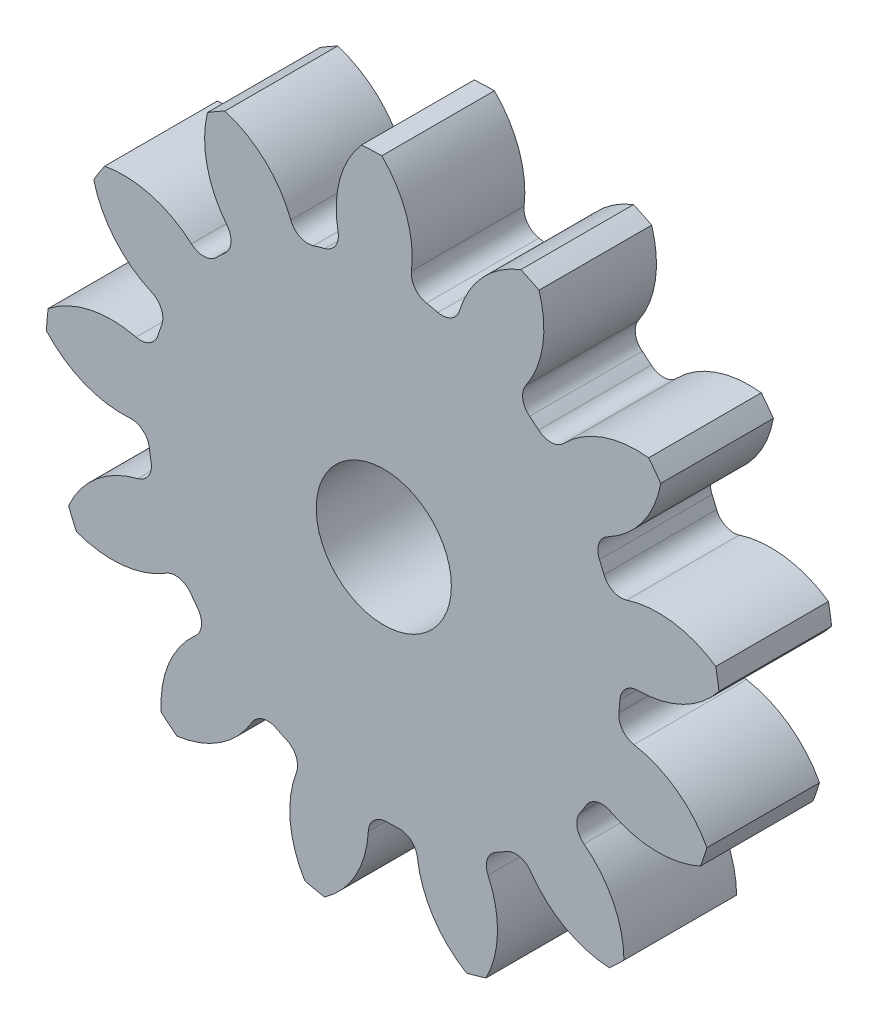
ISO-10303-21;
HEADER;
FILE_DESCRIPTION(('STEP AP214'),'2;1');
FILE_NAME('part.step','',(''),(''),'','','');
FILE_SCHEMA(('AUTOMOTIVE_DESIGN { 1 0 10303 214 1 1 1 1 }'));
ENDSEC;
DATA;
#1=APPLICATION_CONTEXT('core data for automotive mechanical design processes');
#2=APPLICATION_PROTOCOL_DEFINITION('international standard','automotive_design',2000,#1);
#3=PRODUCT_CONTEXT('',#1,'mechanical');
#4=PRODUCT('Part','Part','',(#3));
#5=PRODUCT_RELATED_PRODUCT_CATEGORY('part','',(#4));
#6=PRODUCT_DEFINITION_FORMATION('','',#4);
#7=PRODUCT_DEFINITION_CONTEXT('part definition',#1,'design');
#8=PRODUCT_DEFINITION('design','',#6,#7);
#9=PRODUCT_DEFINITION_SHAPE('','',#8);
#10=(LENGTH_UNIT() NAMED_UNIT(*) SI_UNIT(.MILLI.,.METRE.));
#11=(NAMED_UNIT(*) PLANE_ANGLE_UNIT() SI_UNIT($,.RADIAN.));
#12=(NAMED_UNIT(*) SI_UNIT($,.STERADIAN.) SOLID_ANGLE_UNIT());
#13=UNCERTAINTY_MEASURE_WITH_UNIT(LENGTH_MEASURE(1.E-05),#10,'distance_accuracy_value','');
#14=(GEOMETRIC_REPRESENTATION_CONTEXT(3) GLOBAL_UNCERTAINTY_ASSIGNED_CONTEXT((#13)) GLOBAL_UNIT_ASSIGNED_CONTEXT((#10,
#11,#12)) REPRESENTATION_CONTEXT('',''));
#15=CARTESIAN_POINT('',(0.,0.,0.));
#16=DIRECTION('',(0.,0.,1.));
#17=DIRECTION('',(1.,0.,0.));
#18=AXIS2_PLACEMENT_3D('',#15,#16,#17);
#19=CARTESIAN_POINT('',(0.,0.,127.));
#20=DIRECTION('',(0.,0.,-1.));
#21=DIRECTION('',(-1.,0.,0.));
#22=AXIS2_PLACEMENT_3D('',#19,#20,#21);
#23=CYLINDRICAL_SURFACE('',#22,381.);
#24=DIRECTION('',(0.,0.,-1.));
#25=VECTOR('',#24,1.);
#26=CARTESIAN_POINT('',(374.391089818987,70.6562938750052,63.5));
#27=LINE('',#26,#25);
#28=CARTESIAN_POINT('',(374.391089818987,70.6562938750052,127.));
#29=VERTEX_POINT('',#28);
#30=CARTESIAN_POINT('',(374.391089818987,70.6562938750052,0.));
#31=VERTEX_POINT('',#30);
#32=EDGE_CURVE('E564',#29,#31,#27,.T.);
#33=ORIENTED_EDGE('',*,*,#32,.F.);
#34=CARTESIAN_POINT('',(0.,0.,127.));
#35=DIRECTION('',(0.,0.,1.));
#36=DIRECTION('',(1.,0.,0.));
#37=AXIS2_PLACEMENT_3D('',#34,#35,#36);
#38=CIRCLE('',#37,381.);
#39=CARTESIAN_POINT('',(377.942020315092,48.1749860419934,127.));
#40=VERTEX_POINT('',#39);
#41=EDGE_CURVE('E1019',#40,#29,#38,.T.);
#42=ORIENTED_EDGE('',*,*,#41,.F.);
#43=DIRECTION('',(0.,0.,-1.));
#44=VECTOR('',#43,1.);
#45=CARTESIAN_POINT('',(377.942020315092,48.1749860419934,63.5));
#46=LINE('',#45,#44);
#47=CARTESIAN_POINT('',(377.942020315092,48.1749860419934,0.));
#48=VERTEX_POINT('',#47);
#49=EDGE_CURVE('E1013',#48,#40,#46,.F.);
#50=ORIENTED_EDGE('',*,*,#49,.F.);
#51=CARTESIAN_POINT('',(0.,0.,0.));
#52=DIRECTION('',(0.,0.,1.));
#53=DIRECTION('',(1.,0.,0.));
#54=AXIS2_PLACEMENT_3D('',#51,#52,#53);
#55=CIRCLE('',#54,381.);
#56=EDGE_CURVE('E1024',#48,#31,#55,.T.);
#57=ORIENTED_EDGE('',*,*,#56,.T.);
#58=EDGE_LOOP('',(#33,#42,#50,#57));
#59=FACE_BOUND('',#58,.T.);
#60=ADVANCED_FACE('F33',(#59),#23,.T.);
#61=DIRECTION('',(0.,0.,-1.));
#62=VECTOR('',#61,1.);
#63=CARTESIAN_POINT('',(312.26300690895,218.295246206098,63.5));
#64=LINE('',#63,#62);
#65=CARTESIAN_POINT('',(312.26300690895,218.295246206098,0.));
#66=VERTEX_POINT('',#65);
#67=CARTESIAN_POINT('',(312.26300690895,218.295246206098,127.));
#68=VERTEX_POINT('',#67);
#69=EDGE_CURVE('E535',#66,#68,#64,.F.);
#70=ORIENTED_EDGE('',*,*,#69,.F.);
#71=CARTESIAN_POINT('',(298.671229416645,236.551256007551,0.));
#72=VERTEX_POINT('',#71);
#73=EDGE_CURVE('E1027',#66,#72,#55,.T.);
#74=ORIENTED_EDGE('',*,*,#73,.T.);
#75=DIRECTION('',(0.,0.,-1.));
#76=VECTOR('',#75,1.);
#77=CARTESIAN_POINT('',(298.671229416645,236.551256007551,63.5));
#78=LINE('',#77,#76);
#79=CARTESIAN_POINT('',(298.671229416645,236.551256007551,127.));
#80=VERTEX_POINT('',#79);
#81=EDGE_CURVE('E597',#80,#72,#78,.T.);
#82=ORIENTED_EDGE('',*,*,#81,.F.);
#83=EDGE_CURVE('E1022',#68,#80,#38,.T.);
#84=ORIENTED_EDGE('',*,*,#83,.F.);
#85=EDGE_LOOP('',(#70,#74,#82,#84));
#86=FACE_BOUND('',#85,.T.);
#87=ADVANCED_FACE('F1176',(#86),#23,.T.);
#88=CARTESIAN_POINT('',(0.,0.,127.));
#89=DIRECTION('',(0.,0.,1.));
#90=DIRECTION('',(1.,0.,0.));
#91=AXIS2_PLACEMENT_3D('',#88,#89,#90);
#92=PLANE('',#91);
#93=CARTESIAN_POINT('',(0.,0.,127.000000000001));
#94=DIRECTION('',(0.,0.,1.));
#95=DIRECTION('',(1.,0.,0.));
#96=AXIS2_PLACEMENT_3D('',#93,#94,#95);
#97=CIRCLE('',#96,76.2);
#98=CARTESIAN_POINT('',(76.2,0.,127.000000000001));
#99=VERTEX_POINT('',#98);
#100=EDGE_CURVE('E552',#99,#99,#97,.T.);
#101=ORIENTED_EDGE('',*,*,#100,.F.);
#102=EDGE_LOOP('',(#101));
#103=FACE_BOUND('',#102,.T.);
#104=ORIENTED_EDGE('',*,*,#41,.T.);
#105=CARTESIAN_POINT('',(309.309263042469,-24.6067872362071,127.));
#106=DIRECTION('',(0.,0.,-1.));
#107=DIRECTION('',(0.885456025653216,0.464723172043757,0.));
#108=AXIS2_PLACEMENT_3D('',#105,#106,#107);
#109=CIRCLE('',#108,115.372001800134);
#110=CARTESIAN_POINT('',(273.900944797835,85.1973556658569,127.));
#111=VERTEX_POINT('',#110);
#112=EDGE_CURVE('E544',#111,#29,#109,.T.);
#113=ORIENTED_EDGE('',*,*,#112,.F.);
#114=CARTESIAN_POINT('',(267.55548651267,104.875150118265,127.));
#115=DIRECTION('',(0.,0.,1.));
#116=DIRECTION('',(-0.885456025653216,-0.464723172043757,0.));
#117=AXIS2_PLACEMENT_3D('',#114,#115,#116);
#118=CIRCLE('',#117,20.6756);
#119=CARTESIAN_POINT('',(248.305869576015,97.3297751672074,127.));
#120=VERTEX_POINT('',#119);
#121=EDGE_CURVE('E542',#120,#111,#118,.T.);
#122=ORIENTED_EDGE('',*,*,#121,.F.);
#123=CARTESIAN_POINT('',(0.,0.,127.));
#124=DIRECTION('',(0.,0.,-1.));
#125=DIRECTION('',(0.885456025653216,0.464723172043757,0.));
#126=AXIS2_PLACEMENT_3D('',#123,#124,#125);
#127=CIRCLE('',#126,266.7);
#128=CARTESIAN_POINT('',(243.18638639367,109.495531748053,127.));
#129=VERTEX_POINT('',#128);
#130=EDGE_CURVE('E527',#129,#120,#127,.T.);
#131=ORIENTED_EDGE('',*,*,#130,.F.);
#132=CARTESIAN_POINT('',(262.039121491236,117.984042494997,127.));
#133=DIRECTION('',(0.,0.,1.));
#134=DIRECTION('',(-0.885456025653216,-0.464723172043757,0.));
#135=AXIS2_PLACEMENT_3D('',#132,#133,#134);
#136=CIRCLE('',#135,20.6756);
#137=CARTESIAN_POINT('',(252.405578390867,136.278174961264,127.));
#138=VERTEX_POINT('',#137);
#139=EDGE_CURVE('E519',#138,#129,#136,.T.);
#140=ORIENTED_EDGE('',*,*,#139,.F.);
#141=CARTESIAN_POINT('',(198.649404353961,238.361339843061,127.));
#142=DIRECTION('',(0.,0.,-1.));
#143=DIRECTION('',(-0.885456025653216,-0.464723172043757,0.));
#144=AXIS2_PLACEMENT_3D('',#141,#142,#143);
#145=CIRCLE('',#144,115.372001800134);
#146=EDGE_CURVE('E549',#68,#138,#145,.T.);
#147=ORIENTED_EDGE('',*,*,#146,.F.);
#148=ORIENTED_EDGE('',*,*,#83,.T.);
#149=CARTESIAN_POINT('',(285.315094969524,121.95495383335,127.));
#150=DIRECTION('',(0.,0.,-1.));
#151=DIRECTION('',(0.568064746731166,0.822983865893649,0.));
#152=AXIS2_PLACEMENT_3D('',#149,#150,#151);
#153=CIRCLE('',#152,115.372001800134);
#154=CARTESIAN_POINT('',(202.934056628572,202.726627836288,127.));
#155=VERTEX_POINT('',#154);
#156=EDGE_CURVE('E573',#155,#80,#153,.T.);
#157=ORIENTED_EDGE('',*,*,#156,.F.);
#158=CARTESIAN_POINT('',(188.170705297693,217.201568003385,127.));
#159=DIRECTION('',(0.,0.,1.));
#160=DIRECTION('',(-0.568064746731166,-0.822983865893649,0.));
#161=AXIS2_PLACEMENT_3D('',#158,#159,#160);
#162=CIRCLE('',#161,20.6756);
#163=CARTESIAN_POINT('',(174.632526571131,201.574727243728,127.));
#164=VERTEX_POINT('',#163);
#165=EDGE_CURVE('E571',#164,#155,#162,.T.);
#166=ORIENTED_EDGE('',*,*,#165,.F.);
#167=CARTESIAN_POINT('',(0.,0.,127.));
#168=DIRECTION('',(0.,0.,-1.));
#169=DIRECTION('',(0.568064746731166,0.822983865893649,0.));
#170=AXIS2_PLACEMENT_3D('',#167,#168,#169);
#171=CIRCLE('',#170,266.7);
#172=CARTESIAN_POINT('',(164.44574035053,209.967827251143,127.));
#173=VERTEX_POINT('',#172);
#174=EDGE_CURVE('E568',#173,#164,#171,.T.);
#175=ORIENTED_EDGE('',*,*,#174,.F.);
#176=CARTESIAN_POINT('',(177.194200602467,226.245333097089,127.));
#177=DIRECTION('',(0.,0.,1.));
#178=DIRECTION('',(-0.568064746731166,-0.822983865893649,0.));
#179=AXIS2_PLACEMENT_3D('',#176,#177,#178);
#180=CIRCLE('',#179,20.6756);
#181=CARTESIAN_POINT('',(160.162414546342,237.96705221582,127.));
#182=VERTEX_POINT('',#181);
#183=EDGE_CURVE('E566',#182,#173,#180,.T.);
#184=ORIENTED_EDGE('',*,*,#183,.F.);
#185=CARTESIAN_POINT('',(65.123274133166,303.375465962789,127.));
#186=DIRECTION('',(0.,0.,-1.));
#187=DIRECTION('',(-0.568064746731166,-0.822983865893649,0.));
#188=AXIS2_PLACEMENT_3D('',#185,#186,#187);
#189=CIRCLE('',#188,115.372001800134);
#190=CARTESIAN_POINT('',(175.048301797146,338.406696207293,127.));
#191=VERTEX_POINT('',#190);
#192=EDGE_CURVE('E576',#191,#182,#189,.T.);
#193=ORIENTED_EDGE('',*,*,#192,.F.);
#194=CARTESIAN_POINT('',(154.529389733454,348.255176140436,127.));
#195=VERTEX_POINT('',#194);
#196=EDGE_CURVE('E1061',#191,#195,#38,.T.);
#197=ORIENTED_EDGE('',*,*,#196,.T.);
#198=CARTESIAN_POINT('',(195.958677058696,240.578284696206,127.));
#199=DIRECTION('',(0.,0.,-1.));
#200=DIRECTION('',(0.120536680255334,0.992708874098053,0.));
#201=AXIS2_PLACEMENT_3D('',#198,#199,#200);
#202=CIRCLE('',#201,115.372001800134);
#203=CARTESIAN_POINT('',(85.477421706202,273.813672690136,127.));
#204=VERTEX_POINT('',#203);
#205=EDGE_CURVE('E608',#204,#195,#202,.T.);
#206=ORIENTED_EDGE('',*,*,#205,.F.);
#207=CARTESIAN_POINT('',(65.6782832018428,279.769724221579,127.));
#208=DIRECTION('',(0.,0.,1.));
#209=DIRECTION('',(-0.120536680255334,-0.992708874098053,0.));
#210=AXIS2_PLACEMENT_3D('',#207,#208,#209);
#211=CIRCLE('',#210,20.6756);
#212=CARTESIAN_POINT('',(60.952976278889,259.641338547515,127.));
#213=VERTEX_POINT('',#212);
#214=EDGE_CURVE('E606',#213,#204,#211,.T.);
#215=ORIENTED_EDGE('',*,*,#214,.F.);
#216=CARTESIAN_POINT('',(0.,0.,127.));
#217=DIRECTION('',(0.,0.,-1.));
#218=DIRECTION('',(0.120536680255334,0.992708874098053,0.));
#219=AXIS2_PLACEMENT_3D('',#216,#217,#218);
#220=CIRCLE('',#219,266.7);
#221=CARTESIAN_POINT('',(48.0325569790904,262.339023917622,127.));
#222=VERTEX_POINT('',#221);
#223=EDGE_CURVE('E603',#222,#213,#220,.T.);
#224=ORIENTED_EDGE('',*,*,#223,.F.);
#225=CARTESIAN_POINT('',(51.7562237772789,282.676544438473,127.));
#226=DIRECTION('',(0.,0.,1.));
#227=DIRECTION('',(-0.120536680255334,-0.992708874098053,0.));
#228=AXIS2_PLACEMENT_3D('',#225,#226,#227);
#229=CIRCLE('',#228,20.6756);
#230=CARTESIAN_POINT('',(31.2279716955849,285.140545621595,127.));
#231=VERTEX_POINT('',#230);
#232=EDGE_CURVE('E601',#231,#222,#229,.T.);
#233=ORIENTED_EDGE('',*,*,#232,.F.);
#234=CARTESIAN_POINT('',(-83.3218133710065,298.889928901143,127.));
#235=DIRECTION('',(0.,0.,-1.));
#236=DIRECTION('',(-0.120536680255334,-0.992708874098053,0.));
#237=AXIS2_PLACEMENT_3D('',#234,#235,#236);
#238=CIRCLE('',#237,115.372001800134);
#239=CARTESIAN_POINT('',(-2.26785969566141,380.993250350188,127.));
#240=VERTEX_POINT('',#239);
#241=EDGE_CURVE('E611',#240,#231,#238,.T.);
#242=ORIENTED_EDGE('',*,*,#241,.F.);
#243=CARTESIAN_POINT('',(-25.0132708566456,380.178032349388,127.));
#244=VERTEX_POINT('',#243);
#245=EDGE_CURVE('E1158',#240,#244,#38,.T.);
#246=ORIENTED_EDGE('',*,*,#245,.T.);
#247=CARTESIAN_POINT('',(61.7104877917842,304.088029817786,127.));
#248=DIRECTION('',(0.,0.,-1.));
#249=DIRECTION('',(-0.354604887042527,0.935016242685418,0.));
#250=AXIS2_PLACEMENT_3D('',#247,#248,#249);
#251=CIRCLE('',#250,115.372001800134);
#252=CARTESIAN_POINT('',(-51.5610604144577,282.173304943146,127.));
#253=VERTEX_POINT('',#252);
#254=EDGE_CURVE('E646',#253,#244,#251,.T.);
#255=ORIENTED_EDGE('',*,*,#254,.F.);
#256=CARTESIAN_POINT('',(-71.8602420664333,278.246008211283,127.));
#257=DIRECTION('',(0.,0.,1.));
#258=DIRECTION('',(0.354604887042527,-0.935016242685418,0.));
#259=AXIS2_PLACEMENT_3D('',#256,#257,#258);
#260=CIRCLE('',#259,20.6756);
#261=CARTESIAN_POINT('',(-66.690166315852,258.227248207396,127.));
#262=VERTEX_POINT('',#261);
#263=EDGE_CURVE('E644',#262,#253,#260,.T.);
#264=ORIENTED_EDGE('',*,*,#263,.F.);
#265=CARTESIAN_POINT('',(0.,0.,127.));
#266=DIRECTION('',(0.,0.,-1.));
#267=DIRECTION('',(-0.354604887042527,0.935016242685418,0.));
#268=AXIS2_PLACEMENT_3D('',#265,#266,#267);
#269=CIRCLE('',#268,266.7);
#270=CARTESIAN_POINT('',(-79.3843063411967,254.611511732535,127.));
#271=VERTEX_POINT('',#270);
#272=EDGE_CURVE('E641',#271,#262,#269,.T.);
#273=ORIENTED_EDGE('',*,*,#272,.F.);
#274=CARTESIAN_POINT('',(-85.5384801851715,274.349966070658,127.));
#275=DIRECTION('',(0.,0.,1.));
#276=DIRECTION('',(0.354604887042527,-0.935016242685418,0.));
#277=AXIS2_PLACEMENT_3D('',#274,#275,#276);
#278=CIRCLE('',#277,20.6756);
#279=CARTESIAN_POINT('',(-104.860423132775,266.99177634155,127.));
#280=VERTEX_POINT('',#279);
#281=EDGE_CURVE('E639',#280,#271,#278,.T.);
#282=ORIENTED_EDGE('',*,*,#281,.F.);
#283=CARTESIAN_POINT('',(-212.678877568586,225.932311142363,127.));
#284=DIRECTION('',(0.,0.,-1.));
#285=DIRECTION('',(0.354604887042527,-0.935016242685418,0.));
#286=AXIS2_PLACEMENT_3D('',#283,#284,#285);
#287=CIRCLE('',#286,115.372001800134);
#288=CARTESIAN_POINT('',(-179.064481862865,336.298842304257,127.));
#289=VERTEX_POINT('',#288);
#290=EDGE_CURVE('E649',#289,#280,#287,.T.);
#291=ORIENTED_EDGE('',*,*,#290,.F.);
#292=CARTESIAN_POINT('',(-198.825692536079,325.006682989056,127.));
#293=VERTEX_POINT('',#292);
#294=EDGE_CURVE('E1154',#289,#293,#38,.T.);
#295=ORIENTED_EDGE('',*,*,#294,.T.);
#296=CARTESIAN_POINT('',(-86.6748305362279,297.934871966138,127.));
#297=DIRECTION('',(0.,0.,-1.));
#298=DIRECTION('',(-0.748510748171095,0.663122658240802,0.));
#299=AXIS2_PLACEMENT_3D('',#296,#297,#298);
#300=CIRCLE('',#299,115.372001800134);
#301=CARTESIAN_POINT('',(-176.787524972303,225.890433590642,127.));
#302=VERTEX_POINT('',#301);
#303=EDGE_CURVE('E684',#302,#293,#300,.T.);
#304=ORIENTED_EDGE('',*,*,#303,.F.);
#305=CARTESIAN_POINT('',(-192.936451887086,212.979484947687,127.));
#306=DIRECTION('',(0.,0.,1.));
#307=DIRECTION('',(0.748510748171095,-0.663122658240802,0.));
#308=AXIS2_PLACEMENT_3D('',#305,#306,#307);
#309=CIRCLE('',#308,20.6756);
#310=CARTESIAN_POINT('',(-179.055395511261,197.656407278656,127.));
#311=VERTEX_POINT('',#310);
#312=EDGE_CURVE('E682',#311,#302,#309,.T.);
#313=ORIENTED_EDGE('',*,*,#312,.F.);
#314=CARTESIAN_POINT('',(0.,0.,127.));
#315=DIRECTION('',(0.,0.,-1.));
#316=DIRECTION('',(-0.748510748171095,0.663122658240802,0.));
#317=AXIS2_PLACEMENT_3D('',#314,#315,#316);
#318=CIRCLE('',#317,266.7);
#319=CARTESIAN_POINT('',(-188.615181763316,188.555570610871,127.));
#320=VERTEX_POINT('',#319);
#321=EDGE_CURVE('E679',#320,#311,#318,.T.);
#322=ORIENTED_EDGE('',*,*,#321,.F.);
#323=CARTESIAN_POINT('',(-203.237349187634,203.173116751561,127.));
#324=DIRECTION('',(0.,0.,1.));
#325=DIRECTION('',(0.748510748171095,-0.663122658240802,0.));
#326=AXIS2_PLACEMENT_3D('',#323,#324,#325);
#327=CIRCLE('',#326,20.6756);
#328=CARTESIAN_POINT('',(-216.926558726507,187.678408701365,127.));
#329=VERTEX_POINT('',#328);
#330=EDGE_CURVE('E677',#329,#320,#327,.T.);
#331=ORIENTED_EDGE('',*,*,#330,.F.);
#332=CARTESIAN_POINT('',(-293.313773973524,101.216323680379,127.));
#333=DIRECTION('',(0.,0.,-1.));
#334=DIRECTION('',(0.748510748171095,-0.663122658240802,0.));
#335=AXIS2_PLACEMENT_3D('',#332,#333,#334);
#336=CIRCLE('',#335,115.372001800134);
#337=CARTESIAN_POINT('',(-314.839589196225,214.562422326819,127.));
#338=VERTEX_POINT('',#337);
#339=EDGE_CURVE('E687',#338,#329,#336,.T.);
#340=ORIENTED_EDGE('',*,*,#339,.F.);
#341=CARTESIAN_POINT('',(-327.089544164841,195.380219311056,127.));
#342=VERTEX_POINT('',#341);
#343=EDGE_CURVE('E1150',#338,#342,#38,.T.);
#344=ORIENTED_EDGE('',*,*,#343,.T.);
#345=CARTESIAN_POINT('',(-215.203989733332,223.528425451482,127.));
#346=DIRECTION('',(0.,0.,-1.));
#347=DIRECTION('',(-0.97094181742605,0.239315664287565,0.));
#348=AXIS2_PLACEMENT_3D('',#345,#346,#347);
#349=CIRCLE('',#348,115.372001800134);
#350=CARTESIAN_POINT('',(-261.514098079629,117.858786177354,127.));
#351=VERTEX_POINT('',#350);
#352=EDGE_CURVE('E722',#351,#342,#349,.T.);
#353=ORIENTED_EDGE('',*,*,#352,.F.);
#354=CARTESIAN_POINT('',(-269.813245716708,98.9219283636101,127.));
#355=DIRECTION('',(0.,0.,1.));
#356=DIRECTION('',(0.97094181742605,-0.239315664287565,0.));
#357=AXIS2_PLACEMENT_3D('',#354,#355,#356);
#358=CIRCLE('',#357,20.6756);
#359=CARTESIAN_POINT('',(-250.401191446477,91.8048654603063,127.));
#360=VERTEX_POINT('',#359);
#361=EDGE_CURVE('E720',#360,#351,#358,.T.);
#362=ORIENTED_EDGE('',*,*,#361,.F.);
#363=CARTESIAN_POINT('',(0.,0.,127.));
#364=DIRECTION('',(0.,0.,-1.));
#365=DIRECTION('',(-0.97094181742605,0.239315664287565,0.));
#366=AXIS2_PLACEMENT_3D('',#363,#364,#365);
#367=CIRCLE('',#366,266.7);
#368=CARTESIAN_POINT('',(-254.636592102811,79.3038206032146,127.));
#369=VERTEX_POINT('',#368);
#370=EDGE_CURVE('E717',#369,#360,#367,.T.);
#371=ORIENTED_EDGE('',*,*,#370,.F.);
#372=CARTESIAN_POINT('',(-274.376990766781,85.4517548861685,127.));
#373=DIRECTION('',(0.,0.,1.));
#374=DIRECTION('',(0.97094181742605,-0.239315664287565,0.));
#375=AXIS2_PLACEMENT_3D('',#372,#373,#374);
#376=CIRCLE('',#375,20.6756);
#377=CARTESIAN_POINT('',(-279.297433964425,65.3701793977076,127.));
#378=VERTEX_POINT('',#377);
#379=EDGE_CURVE('E715',#378,#369,#376,.T.);
#380=ORIENTED_EDGE('',*,*,#379,.F.);
#381=CARTESIAN_POINT('',(-306.754019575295,-46.6871037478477,127.));
#382=DIRECTION('',(0.,0.,-1.));
#383=DIRECTION('',(0.97094181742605,-0.239315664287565,0.));
#384=AXIS2_PLACEMENT_3D('',#381,#382,#383);
#385=CIRCLE('',#384,115.372001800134);
#386=CARTESIAN_POINT('',(-378.488740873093,43.6723371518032,127.));
#387=VERTEX_POINT('',#386);
#388=EDGE_CURVE('E725',#387,#378,#385,.T.);
#389=ORIENTED_EDGE('',*,*,#388,.F.);
#390=CARTESIAN_POINT('',(-380.421123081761,20.9945019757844,127.));
#391=VERTEX_POINT('',#390);
#392=EDGE_CURVE('E1146',#387,#391,#38,.T.);
#393=ORIENTED_EDGE('',*,*,#392,.T.);
#394=CARTESIAN_POINT('',(-294.432508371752,97.9143104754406,127.));
#395=DIRECTION('',(0.,0.,-1.));
#396=DIRECTION('',(-0.970941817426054,-0.239315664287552,0.));
#397=AXIS2_PLACEMENT_3D('',#394,#395,#396);
#398=CIRCLE('',#397,115.372001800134);
#399=CARTESIAN_POINT('',(-286.33094290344,-17.1728887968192,127.));
#400=VERTEX_POINT('',#399);
#401=EDGE_CURVE('E760',#400,#391,#398,.T.);
#402=ORIENTED_EDGE('',*,*,#401,.F.);
#403=CARTESIAN_POINT('',(-284.879076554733,-37.7974498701,127.));
#404=DIRECTION('',(0.,0.,1.));
#405=DIRECTION('',(0.970941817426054,0.239315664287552,0.));
#406=AXIS2_PLACEMENT_3D('',#403,#404,#405);
#407=CIRCLE('',#406,20.6756);
#408=CARTESIAN_POINT('',(-264.383092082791,-35.0780646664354,127.));
#409=VERTEX_POINT('',#408);
#410=EDGE_CURVE('E758',#409,#400,#407,.T.);
#411=ORIENTED_EDGE('',*,*,#410,.F.);
#412=CARTESIAN_POINT('',(0.,0.,127.));
#413=DIRECTION('',(0.,0.,-1.));
#414=DIRECTION('',(-0.970941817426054,-0.239315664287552,0.));
#415=AXIS2_PLACEMENT_3D('',#412,#413,#414);
#416=CIRCLE('',#415,266.7);
#417=CARTESIAN_POINT('',(-262.323827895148,-48.1154789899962,127.));
#418=VERTEX_POINT('',#417);
#419=EDGE_CURVE('E755',#418,#409,#416,.T.);
#420=ORIENTED_EDGE('',*,*,#419,.F.);
#421=CARTESIAN_POINT('',(-282.660170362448,-51.8455742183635,127.));
#422=DIRECTION('',(0.,0.,1.));
#423=DIRECTION('',(0.970941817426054,0.239315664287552,0.));
#424=AXIS2_PLACEMENT_3D('',#421,#422,#423);
#425=CIRCLE('',#424,20.6756);
#426=CARTESIAN_POINT('',(-277.684632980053,-71.9135702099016,127.));
#427=VERTEX_POINT('',#426);
#428=EDGE_CURVE('E753',#427,#418,#425,.T.);
#429=ORIENTED_EDGE('',*,*,#428,.F.);
#430=CARTESIAN_POINT('',(-249.920616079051,-183.895078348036,127.));
#431=DIRECTION('',(0.,0.,-1.));
#432=DIRECTION('',(0.970941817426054,0.239315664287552,0.));
#433=AXIS2_PLACEMENT_3D('',#430,#431,#432);
#434=CIRCLE('',#433,115.372001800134);
#435=CARTESIAN_POINT('',(-355.430683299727,-137.222554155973,127.));
#436=VERTEX_POINT('',#435);
#437=EDGE_CURVE('E763',#436,#427,#434,.T.);
#438=ORIENTED_EDGE('',*,*,#437,.F.);
#439=CARTESIAN_POINT('',(-346.602807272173,-158.200802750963,127.));
#440=VERTEX_POINT('',#439);
#441=EDGE_CURVE('E1142',#436,#440,#38,.T.);
#442=ORIENTED_EDGE('',*,*,#441,.T.);
#443=CARTESIAN_POINT('',(-306.210087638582,-50.1307930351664,127.));
#444=DIRECTION('',(0.,0.,-1.));
#445=DIRECTION('',(-0.748510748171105,-0.663122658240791,0.));
#446=AXIS2_PLACEMENT_3D('',#443,#444,#445);
#447=CIRCLE('',#446,115.372001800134);
#448=CARTESIAN_POINT('',(-245.552819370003,-148.270461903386,127.));
#449=VERTEX_POINT('',#448);
#450=EDGE_CURVE('E798',#449,#440,#447,.T.);
#451=ORIENTED_EDGE('',*,*,#450,.F.);
#452=CARTESIAN_POINT('',(-234.682544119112,-165.85788784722,127.));
#453=DIRECTION('',(0.,0.,1.));
#454=DIRECTION('',(0.748510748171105,0.663122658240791,0.));
#455=AXIS2_PLACEMENT_3D('',#452,#453,#454);
#456=CIRCLE('',#455,20.6756);
#457=CARTESIAN_POINT('',(-217.798012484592,-153.925032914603,127.));
#458=VERTEX_POINT('',#457);
#459=EDGE_CURVE('E796',#458,#449,#456,.T.);
#460=ORIENTED_EDGE('',*,*,#459,.F.);
#461=CARTESIAN_POINT('',(0.,0.,127.));
#462=DIRECTION('',(0.,0.,-1.));
#463=DIRECTION('',(-0.748510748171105,-0.663122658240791,0.));
#464=AXIS2_PLACEMENT_3D('',#461,#462,#463);
#465=CIRCLE('',#464,266.7);
#466=CARTESIAN_POINT('',(-209.915836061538,-164.51210220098,127.));
#467=VERTEX_POINT('',#466);
#468=EDGE_CURVE('E793',#467,#458,#465,.T.);
#469=ORIENTED_EDGE('',*,*,#468,.F.);
#470=CARTESIAN_POINT('',(-226.189311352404,-177.26570707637,127.));
#471=DIRECTION('',(0.,0.,1.));
#472=DIRECTION('',(0.748510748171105,0.663122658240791,0.));
#473=AXIS2_PLACEMENT_3D('',#470,#471,#472);
#474=CIRCLE('',#473,20.6756);
#475=CARTESIAN_POINT('',(-212.45762904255,-192.722787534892,127.));
#476=VERTEX_POINT('',#475);
#477=EDGE_CURVE('E791',#476,#467,#474,.T.);
#478=ORIENTED_EDGE('',*,*,#477,.F.);
#479=CARTESIAN_POINT('',(-135.833411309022,-278.974906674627,127.));
#480=DIRECTION('',(0.,0.,-1.));
#481=DIRECTION('',(0.748510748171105,0.663122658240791,0.));
#482=AXIS2_PLACEMENT_3D('',#479,#480,#481);
#483=CIRCLE('',#482,115.372001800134);
#484=CARTESIAN_POINT('',(-250.947739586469,-286.681412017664,127.));
#485=VERTEX_POINT('',#484);
#486=EDGE_CURVE('E801',#485,#476,#483,.T.);
#487=ORIENTED_EDGE('',*,*,#486,.F.);
#488=CARTESIAN_POINT('',(-233.381965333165,-301.154210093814,127.));
#489=VERTEX_POINT('',#488);
#490=EDGE_CURVE('E1138',#485,#489,#38,.T.);
#491=ORIENTED_EDGE('',*,*,#490,.T.);
#492=CARTESIAN_POINT('',(-247.838626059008,-186.691536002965,127.));
#493=DIRECTION('',(0.,0.,-1.));
#494=DIRECTION('',(-0.35460488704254,-0.935016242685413,0.));
#495=AXIS2_PLACEMENT_3D('',#492,#493,#494);
#496=CIRCLE('',#495,115.372001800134);
#497=CARTESIAN_POINT('',(-148.521504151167,-245.401059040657,127.));
#498=VERTEX_POINT('',#497);
#499=EDGE_CURVE('E836',#498,#489,#496,.T.);
#500=ORIENTED_EDGE('',*,*,#499,.F.);
#501=CARTESIAN_POINT('',(-130.723069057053,-255.922282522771,127.));
#502=DIRECTION('',(0.,0.,1.));
#503=DIRECTION('',(0.35460488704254,0.935016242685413,0.));
#504=AXIS2_PLACEMENT_3D('',#501,#502,#503);
#505=CIRCLE('',#504,20.6756);
#506=CARTESIAN_POINT('',(-121.318032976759,-237.509631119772,127.));
#507=VERTEX_POINT('',#506);
#508=EDGE_CURVE('E834',#507,#498,#505,.T.);
#509=ORIENTED_EDGE('',*,*,#508,.F.);
#510=CARTESIAN_POINT('',(0.,0.,127.));
#511=DIRECTION('',(0.,0.,-1.));
#512=DIRECTION('',(-0.35460488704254,-0.935016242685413,0.));
#513=AXIS2_PLACEMENT_3D('',#510,#511,#512);
#514=CIRCLE('',#513,266.7);
#515=CARTESIAN_POINT('',(-109.418655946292,-243.220985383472,127.));
#516=VERTEX_POINT('',#515);
#517=EDGE_CURVE('E831',#516,#507,#514,.T.);
#518=ORIENTED_EDGE('',*,*,#517,.F.);
#519=CARTESIAN_POINT('',(-117.901206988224,-262.076402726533,127.));
#520=DIRECTION('',(0.,0.,1.));
#521=DIRECTION('',(0.35460488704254,0.935016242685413,0.));
#522=AXIS2_PLACEMENT_3D('',#519,#520,#521);
#523=CIRCLE('',#522,20.6756);
#524=CARTESIAN_POINT('',(-98.5591426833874,-269.381536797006,127.));
#525=VERTEX_POINT('',#524);
#526=EDGE_CURVE('E829',#525,#516,#523,.T.);
#527=ORIENTED_EDGE('',*,*,#526,.F.);
#528=CARTESIAN_POINT('',(9.37159102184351,-310.144945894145,127.));
#529=DIRECTION('',(0.,0.,-1.));
#530=DIRECTION('',(0.35460488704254,0.935016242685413,0.));
#531=AXIS2_PLACEMENT_3D('',#528,#529,#530);
#532=CIRCLE('',#531,115.372001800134);
#533=CARTESIAN_POINT('',(-88.9756929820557,-370.465013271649,127.));
#534=VERTEX_POINT('',#533);
#535=EDGE_CURVE('E839',#534,#525,#532,.T.);
#536=ORIENTED_EDGE('',*,*,#535,.F.);
#537=CARTESIAN_POINT('',(-66.6961276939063,-375.116817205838,127.));
#538=VERTEX_POINT('',#537);
#539=EDGE_CURVE('E1134',#534,#538,#38,.T.);
#540=ORIENTED_EDGE('',*,*,#539,.T.);
#541=CARTESIAN_POINT('',(-132.69032202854,-280.48349794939,127.));
#542=DIRECTION('',(0.,0.,-1.));
#543=DIRECTION('',(0.12053668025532,-0.992708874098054,0.));
#544=AXIS2_PLACEMENT_3D('',#541,#542,#543);
#545=CIRCLE('',#544,115.372001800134);
#546=CARTESIAN_POINT('',(-17.4657022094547,-286.313230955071,127.));
#547=VERTEX_POINT('',#546);
#548=EDGE_CURVE('E874',#547,#538,#545,.T.);
#549=ORIENTED_EDGE('',*,*,#548,.F.);
#550=CARTESIAN_POINT('',(3.18348574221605,-287.357966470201,127.));
#551=DIRECTION('',(0.,0.,1.));
#552=DIRECTION('',(-0.12053668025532,0.992708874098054,0.));
#553=AXIS2_PLACEMENT_3D('',#550,#551,#552);
#554=CIRCLE('',#553,20.6756);
#555=CARTESIAN_POINT('',(2.95444584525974,-266.683635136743,127.));
#556=VERTEX_POINT('',#555);
#557=EDGE_CURVE('E872',#556,#547,#554,.T.);
#558=ORIENTED_EDGE('',*,*,#557,.F.);
#559=CARTESIAN_POINT('',(0.,0.,127.));
#560=DIRECTION('',(0.,0.,-1.));
#561=DIRECTION('',(0.12053668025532,-0.992708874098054,0.));
#562=AXIS2_PLACEMENT_3D('',#559,#560,#561);
#563=CIRCLE('',#562,266.7);
#564=CARTESIAN_POINT('',(16.1450196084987,-266.210871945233,127.));
#565=VERTEX_POINT('',#564);
#566=EDGE_CURVE('E869',#565,#556,#563,.T.);
#567=ORIENTED_EDGE('',*,*,#566,.F.);
#568=CARTESIAN_POINT('',(17.3966430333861,-286.848552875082,127.));
#569=DIRECTION('',(0.,0.,1.));
#570=DIRECTION('',(-0.12053668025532,0.992708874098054,0.));
#571=AXIS2_PLACEMENT_3D('',#568,#569,#570);
#572=CIRCLE('',#571,20.6756);
#573=CARTESIAN_POINT('',(37.9180554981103,-284.328222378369,127.));
#574=VERTEX_POINT('',#573);
#575=EDGE_CURVE('E867',#574,#565,#572,.T.);
#576=ORIENTED_EDGE('',*,*,#575,.F.);
#577=CARTESIAN_POINT('',(152.429674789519,-270.264515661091,127.));
#578=DIRECTION('',(0.,0.,-1.));
#579=DIRECTION('',(-0.12053668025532,0.992708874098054,0.));
#580=AXIS2_PLACEMENT_3D('',#577,#578,#579);
#581=CIRCLE('',#580,115.372001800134);
#582=CARTESIAN_POINT('',(93.3796126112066,-369.379544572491,127.));
#583=VERTEX_POINT('',#582);
#584=EDGE_CURVE('E877',#583,#574,#581,.T.);
#585=ORIENTED_EDGE('',*,*,#584,.F.);
#586=CARTESIAN_POINT('',(115.268989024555,-363.144682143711,127.));
#587=VERTEX_POINT('',#586);
#588=EDGE_CURVE('E1130',#583,#587,#38,.T.);
#589=ORIENTED_EDGE('',*,*,#588,.T.);
#590=CARTESIAN_POINT('',(12.8557356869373,-310.020070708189,127.));
#591=DIRECTION('',(0.,0.,-1.));
#592=DIRECTION('',(0.568064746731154,-0.822983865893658,0.));
#593=AXIS2_PLACEMENT_3D('',#590,#591,#592);
#594=CIRCLE('',#593,115.372001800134);
#595=CARTESIAN_POINT('',(117.591281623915,-261.634492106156,127.));
#596=VERTEX_POINT('',#595);
#597=EDGE_CURVE('E912',#596,#587,#594,.T.);
#598=ORIENTED_EDGE('',*,*,#597,.F.);
#599=CARTESIAN_POINT('',(136.360742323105,-252.963403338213,127.));
#600=DIRECTION('',(0.,0.,1.));
#601=DIRECTION('',(-0.568064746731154,0.822983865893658,0.));
#602=AXIS2_PLACEMENT_3D('',#599,#600,#601);
#603=CIRCLE('',#602,20.6756);
#604=CARTESIAN_POINT('',(126.550096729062,-234.76363223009,127.));
#605=VERTEX_POINT('',#604);
#606=EDGE_CURVE('E910',#605,#596,#603,.T.);
#607=ORIENTED_EDGE('',*,*,#606,.F.);
#608=CARTESIAN_POINT('',(0.,0.,127.));
#609=DIRECTION('',(0.,0.,-1.));
#610=DIRECTION('',(0.568064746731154,-0.822983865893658,0.));
#611=AXIS2_PLACEMENT_3D('',#608,#609,#610);
#612=CIRCLE('',#611,266.7);
#613=CARTESIAN_POINT('',(138.010065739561,-228.215055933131,127.));
#614=VERTEX_POINT('',#613);
#615=EDGE_CURVE('E907',#614,#605,#612,.T.);
#616=ORIENTED_EDGE('',*,*,#615,.F.);
#617=CARTESIAN_POINT('',(148.709131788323,-245.907156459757,127.));
#618=DIRECTION('',(0.,0.,1.));
#619=DIRECTION('',(-0.568064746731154,0.822983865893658,0.));
#620=AXIS2_PLACEMENT_3D('',#617,#618,#619);
#621=CIRCLE('',#620,20.6756);
#622=CARTESIAN_POINT('',(165.708684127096,-234.138738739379,127.));
#623=VERTEX_POINT('',#622);
#624=EDGE_CURVE('E905',#623,#614,#621,.T.);
#625=ORIENTED_EDGE('',*,*,#624,.F.);
#626=CARTESIAN_POINT('',(260.567957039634,-168.469741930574,127.));
#627=DIRECTION('',(0.,0.,-1.));
#628=DIRECTION('',(-0.568064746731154,0.822983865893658,0.));
#629=AXIS2_PLACEMENT_3D('',#626,#627,#628);
#630=CIRCLE('',#629,115.372001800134);
#631=CARTESIAN_POINT('',(254.342774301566,-283.673673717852,127.));
#632=VERTEX_POINT('',#631);
#633=EDGE_CURVE('E915',#632,#623,#630,.T.);
#634=ORIENTED_EDGE('',*,*,#633,.F.);
#635=CARTESIAN_POINT('',(270.827369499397,-267.980476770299,127.));
#636=VERTEX_POINT('',#635);
#637=EDGE_CURVE('E1129',#632,#636,#38,.T.);
#638=ORIENTED_EDGE('',*,*,#637,.T.);
#639=CARTESIAN_POINT('',(155.456699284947,-268.53478141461,127.));
#640=DIRECTION('',(0.,0.,-1.));
#641=DIRECTION('',(0.885456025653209,-0.46472317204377,0.));
#642=AXIS2_PLACEMENT_3D('',#639,#640,#641);
#643=CIRCLE('',#642,115.372001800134);
#644=CARTESIAN_POINT('',(225.709519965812,-177.018444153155,127.));
#645=VERTEX_POINT('',#644);
#646=EDGE_CURVE('E950',#645,#636,#643,.T.);
#647=ORIENTED_EDGE('',*,*,#646,.F.);
#648=CARTESIAN_POINT('',(238.29939616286,-160.617973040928,127.));
#649=DIRECTION('',(0.,0.,1.));
#650=DIRECTION('',(-0.885456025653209,0.46472317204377,0.));
#651=AXIS2_PLACEMENT_3D('',#648,#649,#650);
#652=CIRCLE('',#651,20.6756);
#653=CARTESIAN_POINT('',(221.154645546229,-149.062110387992,127.));
#654=VERTEX_POINT('',#653);
#655=EDGE_CURVE('E948',#654,#645,#652,.T.);
#656=ORIENTED_EDGE('',*,*,#655,.F.);
#657=CARTESIAN_POINT('',(0.,0.,127.));
#658=DIRECTION('',(0.,0.,-1.));
#659=DIRECTION('',(0.885456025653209,-0.46472317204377,0.));
#660=AXIS2_PLACEMENT_3D('',#657,#658,#659);
#661=CIRCLE('',#660,266.7);
#662=CARTESIAN_POINT('',(228.25866901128,-137.937920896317,127.));
#663=VERTEX_POINT('',#662);
#664=EDGE_CURVE('E945',#663,#654,#661,.T.);
#665=ORIENTED_EDGE('',*,*,#664,.F.);
#666=CARTESIAN_POINT('',(245.954150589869,-148.631394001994,127.));
#667=DIRECTION('',(0.,0.,1.));
#668=DIRECTION('',(-0.885456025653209,0.46472317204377,0.));
#669=AXIS2_PLACEMENT_3D('',#666,#667,#668);
#670=CIRCLE('',#669,20.6756);
#671=CARTESIAN_POINT('',(255.537450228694,-130.310891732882,127.));
#672=VERTEX_POINT('',#671);
#673=EDGE_CURVE('E943',#672,#663,#670,.T.);
#674=ORIENTED_EDGE('',*,*,#673,.F.);
#675=CARTESIAN_POINT('',(309.013260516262,-28.0805806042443,127.));
#676=DIRECTION('',(0.,0.,-1.));
#677=DIRECTION('',(-0.885456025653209,0.46472317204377,0.));
#678=AXIS2_PLACEMENT_3D('',#675,#676,#677);
#679=CIRCLE('',#678,115.372001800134);
#680=CARTESIAN_POINT('',(357.039071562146,-132.981582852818,127.));
#681=VERTEX_POINT('',#680);
#682=EDGE_CURVE('E953',#681,#672,#679,.T.);
#683=ORIENTED_EDGE('',*,*,#682,.F.);
#684=CARTESIAN_POINT('',(364.342463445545,-111.425173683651,127.));
#685=VERTEX_POINT('',#684);
#686=EDGE_CURVE('E1023',#681,#685,#38,.T.);
#687=ORIENTED_EDGE('',*,*,#686,.T.);
#688=CARTESIAN_POINT('',(262.444406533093,-165.531409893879,127.));
#689=DIRECTION('',(0.,0.,-1.));
#690=DIRECTION('',(1.,0.,0.));
#691=AXIS2_PLACEMENT_3D('',#688,#689,#690);
#692=CIRCLE('',#691,115.372001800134);
#693=CARTESIAN_POINT('',(282.120427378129,-51.8496039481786,127.));
#694=VERTEX_POINT('',#693);
#695=EDGE_CURVE('E988',#694,#685,#692,.T.);
#696=ORIENTED_EDGE('',*,*,#695,.F.);
#697=CARTESIAN_POINT('',(285.646530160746,-31.476900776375,127.));
#698=DIRECTION('',(0.,0.,1.));
#699=DIRECTION('',(-1.,0.,0.));
#700=AXIS2_PLACEMENT_3D('',#697,#698,#699);
#701=CIRCLE('',#700,20.6756);
#702=CARTESIAN_POINT('',(265.095330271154,-29.2122554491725,127.));
#703=VERTEX_POINT('',#702);
#704=EDGE_CURVE('E986',#703,#694,#701,.T.);
#705=ORIENTED_EDGE('',*,*,#704,.F.);
#706=CARTESIAN_POINT('',(0.,0.,127.));
#707=DIRECTION('',(0.,0.,-1.));
#708=DIRECTION('',(1.,0.,0.));
#709=AXIS2_PLACEMENT_3D('',#706,#707,#708);
#710=CIRCLE('',#709,266.7);
#711=CARTESIAN_POINT('',(266.215962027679,-16.0608705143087,127.));
#712=VERTEX_POINT('',#711);
#713=EDGE_CURVE('E983',#712,#703,#710,.T.);
#714=ORIENTED_EDGE('',*,*,#713,.F.);
#715=CARTESIAN_POINT('',(286.85403756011,-17.3059703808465,127.));
#716=DIRECTION('',(0.,0.,1.));
#717=DIRECTION('',(-1.,0.,0.));
#718=AXIS2_PLACEMENT_3D('',#715,#716,#717);
#719=CIRCLE('',#718,20.6756);
#720=CARTESIAN_POINT('',(286.825666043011,3.36961015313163,127.));
#721=VERTEX_POINT('',#720);
#722=EDGE_CURVE('E981',#721,#712,#719,.T.);
#723=ORIENTED_EDGE('',*,*,#722,.F.);
#724=CARTESIAN_POINT('',(286.667350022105,118.741503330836,127.));
#725=DIRECTION('',(0.,0.,-1.));
#726=DIRECTION('',(-1.,0.,0.));
#727=AXIS2_PLACEMENT_3D('',#724,#725,#726);
#728=CIRCLE('',#727,115.372001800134);
#729=EDGE_CURVE('E991',#40,#721,#728,.T.);
#730=ORIENTED_EDGE('',*,*,#729,.F.);
#731=EDGE_LOOP('',(#104,#113,#122,#131,#140,#147,#148,#157,#166,#175,#184,#193,#197,#206,#215,
#224,#233,#242,#246,#255,#264,#273,#282,#291,#295,#304,#313,#322,#331,#340,#344,#353,#362,#371,
#380,#389,#393,#402,#411,#420,#429,#438,#442,#451,#460,#469,#478,#487,#491,#500,#509,#518,#527,
#536,#540,#549,#558,#567,#576,#585,#589,#598,#607,#616,#625,#634,#638,#647,#656,#665,#674,#683,
#687,#696,#705,#714,#723,#730));
#732=FACE_BOUND('',#731,.T.);
#733=ADVANCED_FACE('F540',(#103,#732),#92,.T.);
#734=CARTESIAN_POINT('',(0.,0.,0.));
#735=DIRECTION('',(0.,0.,1.));
#736=DIRECTION('',(1.,0.,0.));
#737=AXIS2_PLACEMENT_3D('',#734,#735,#736);
#738=PLANE('',#737);
#739=CARTESIAN_POINT('',(0.,0.,0.));
#740=DIRECTION('',(0.,0.,1.));
#741=DIRECTION('',(1.,0.,0.));
#742=AXIS2_PLACEMENT_3D('',#739,#740,#741);
#743=CIRCLE('',#742,76.2);
#744=CARTESIAN_POINT('',(76.2,0.,-1.77635683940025E-12));
#745=VERTEX_POINT('',#744);
#746=EDGE_CURVE('E36',#745,#745,#743,.T.);
#747=ORIENTED_EDGE('',*,*,#746,.T.);
#748=EDGE_LOOP('',(#747));
#749=FACE_BOUND('',#748,.T.);
#750=CARTESIAN_POINT('',(309.309263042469,-24.6067872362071,0.));
#751=DIRECTION('',(0.,0.,-1.));
#752=DIRECTION('',(0.885456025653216,0.464723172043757,0.));
#753=AXIS2_PLACEMENT_3D('',#750,#751,#752);
#754=CIRCLE('',#753,115.372001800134);
#755=CARTESIAN_POINT('',(273.900944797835,85.1973556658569,0.));
#756=VERTEX_POINT('',#755);
#757=EDGE_CURVE('E528',#756,#31,#754,.T.);
#758=ORIENTED_EDGE('',*,*,#757,.T.);
#759=ORIENTED_EDGE('',*,*,#56,.F.);
#760=CARTESIAN_POINT('',(286.667350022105,118.741503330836,0.));
#761=DIRECTION('',(0.,0.,1.));
#762=DIRECTION('',(1.,0.,0.));
#763=AXIS2_PLACEMENT_3D('',#760,#761,#762);
#764=CIRCLE('',#763,115.372001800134);
#765=CARTESIAN_POINT('',(286.825666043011,3.36961015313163,0.));
#766=VERTEX_POINT('',#765);
#767=EDGE_CURVE('E1021',#766,#48,#764,.T.);
#768=ORIENTED_EDGE('',*,*,#767,.F.);
#769=CARTESIAN_POINT('',(286.85403756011,-17.3059703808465,0.));
#770=DIRECTION('',(0.,0.,1.));
#771=DIRECTION('',(-1.,0.,0.));
#772=AXIS2_PLACEMENT_3D('',#769,#770,#771);
#773=CIRCLE('',#772,20.6756);
#774=CARTESIAN_POINT('',(266.215962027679,-16.0608705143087,0.));
#775=VERTEX_POINT('',#774);
#776=EDGE_CURVE('E980',#766,#775,#773,.T.);
#777=ORIENTED_EDGE('',*,*,#776,.T.);
#778=CARTESIAN_POINT('',(0.,0.,0.));
#779=DIRECTION('',(0.,0.,-1.));
#780=DIRECTION('',(1.,0.,0.));
#781=AXIS2_PLACEMENT_3D('',#778,#779,#780);
#782=CIRCLE('',#781,266.7);
#783=CARTESIAN_POINT('',(265.095330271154,-29.2122554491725,0.));
#784=VERTEX_POINT('',#783);
#785=EDGE_CURVE('E996',#775,#784,#782,.T.);
#786=ORIENTED_EDGE('',*,*,#785,.T.);
#787=CARTESIAN_POINT('',(285.646530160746,-31.476900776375,0.));
#788=DIRECTION('',(0.,0.,1.));
#789=DIRECTION('',(-1.,0.,0.));
#790=AXIS2_PLACEMENT_3D('',#787,#788,#789);
#791=CIRCLE('',#790,20.6756);
#792=CARTESIAN_POINT('',(282.120427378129,-51.8496039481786,0.));
#793=VERTEX_POINT('',#792);
#794=EDGE_CURVE('E999',#784,#793,#791,.T.);
#795=ORIENTED_EDGE('',*,*,#794,.T.);
#796=CARTESIAN_POINT('',(262.444406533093,-165.531409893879,0.));
#797=DIRECTION('',(0.,0.,-1.));
#798=DIRECTION('',(1.,0.,0.));
#799=AXIS2_PLACEMENT_3D('',#796,#797,#798);
#800=CIRCLE('',#799,115.372001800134);
#801=CARTESIAN_POINT('',(364.342463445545,-111.425173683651,0.));
#802=VERTEX_POINT('',#801);
#803=EDGE_CURVE('E984',#793,#802,#800,.T.);
#804=ORIENTED_EDGE('',*,*,#803,.T.);
#805=CARTESIAN_POINT('',(357.039071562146,-132.981582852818,0.));
#806=VERTEX_POINT('',#805);
#807=EDGE_CURVE('E1018',#806,#802,#55,.T.);
#808=ORIENTED_EDGE('',*,*,#807,.F.);
#809=CARTESIAN_POINT('',(309.013260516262,-28.0805806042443,0.));
#810=DIRECTION('',(0.,0.,1.));
#811=DIRECTION('',(1.,0.,0.));
#812=AXIS2_PLACEMENT_3D('',#809,#810,#811);
#813=CIRCLE('',#812,115.372001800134);
#814=CARTESIAN_POINT('',(255.537450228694,-130.310891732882,0.));
#815=VERTEX_POINT('',#814);
#816=EDGE_CURVE('E1029',#815,#806,#813,.T.);
#817=ORIENTED_EDGE('',*,*,#816,.F.);
#818=CARTESIAN_POINT('',(245.954150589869,-148.631394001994,0.));
#819=DIRECTION('',(0.,0.,1.));
#820=DIRECTION('',(-0.885456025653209,0.46472317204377,0.));
#821=AXIS2_PLACEMENT_3D('',#818,#819,#820);
#822=CIRCLE('',#821,20.6756);
#823=CARTESIAN_POINT('',(228.25866901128,-137.937920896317,0.));
#824=VERTEX_POINT('',#823);
#825=EDGE_CURVE('E942',#815,#824,#822,.T.);
#826=ORIENTED_EDGE('',*,*,#825,.T.);
#827=CARTESIAN_POINT('',(0.,0.,0.));
#828=DIRECTION('',(0.,0.,-1.));
#829=DIRECTION('',(0.885456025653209,-0.46472317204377,0.));
#830=AXIS2_PLACEMENT_3D('',#827,#828,#829);
#831=CIRCLE('',#830,266.7);
#832=CARTESIAN_POINT('',(221.154645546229,-149.062110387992,0.));
#833=VERTEX_POINT('',#832);
#834=EDGE_CURVE('E958',#824,#833,#831,.T.);
#835=ORIENTED_EDGE('',*,*,#834,.T.);
#836=CARTESIAN_POINT('',(238.29939616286,-160.617973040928,0.));
#837=DIRECTION('',(0.,0.,1.));
#838=DIRECTION('',(-0.885456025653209,0.46472317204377,0.));
#839=AXIS2_PLACEMENT_3D('',#836,#837,#838);
#840=CIRCLE('',#839,20.6756);
#841=CARTESIAN_POINT('',(225.709519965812,-177.018444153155,0.));
#842=VERTEX_POINT('',#841);
#843=EDGE_CURVE('E961',#833,#842,#840,.T.);
#844=ORIENTED_EDGE('',*,*,#843,.T.);
#845=CARTESIAN_POINT('',(155.456699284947,-268.53478141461,0.));
#846=DIRECTION('',(0.,0.,-1.));
#847=DIRECTION('',(0.885456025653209,-0.46472317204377,0.));
#848=AXIS2_PLACEMENT_3D('',#845,#846,#847);
#849=CIRCLE('',#848,115.372001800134);
#850=CARTESIAN_POINT('',(270.827369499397,-267.980476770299,0.));
#851=VERTEX_POINT('',#850);
#852=EDGE_CURVE('E946',#842,#851,#849,.T.);
#853=ORIENTED_EDGE('',*,*,#852,.T.);
#854=CARTESIAN_POINT('',(254.342774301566,-283.673673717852,0.));
#855=VERTEX_POINT('',#854);
#856=EDGE_CURVE('E1100',#855,#851,#55,.T.);
#857=ORIENTED_EDGE('',*,*,#856,.F.);
#858=CARTESIAN_POINT('',(260.567957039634,-168.469741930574,0.));
#859=DIRECTION('',(0.,0.,1.));
#860=DIRECTION('',(1.,0.,0.));
#861=AXIS2_PLACEMENT_3D('',#858,#859,#860);
#862=CIRCLE('',#861,115.372001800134);
#863=CARTESIAN_POINT('',(165.708684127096,-234.138738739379,0.));
#864=VERTEX_POINT('',#863);
#865=EDGE_CURVE('E1031',#864,#855,#862,.T.);
#866=ORIENTED_EDGE('',*,*,#865,.F.);
#867=CARTESIAN_POINT('',(148.709131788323,-245.907156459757,0.));
#868=DIRECTION('',(0.,0.,1.));
#869=DIRECTION('',(-0.568064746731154,0.822983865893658,0.));
#870=AXIS2_PLACEMENT_3D('',#867,#868,#869);
#871=CIRCLE('',#870,20.6756);
#872=CARTESIAN_POINT('',(138.010065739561,-228.215055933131,0.));
#873=VERTEX_POINT('',#872);
#874=EDGE_CURVE('E904',#864,#873,#871,.T.);
#875=ORIENTED_EDGE('',*,*,#874,.T.);
#876=CARTESIAN_POINT('',(0.,0.,0.));
#877=DIRECTION('',(0.,0.,-1.));
#878=DIRECTION('',(0.568064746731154,-0.822983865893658,0.));
#879=AXIS2_PLACEMENT_3D('',#876,#877,#878);
#880=CIRCLE('',#879,266.7);
#881=CARTESIAN_POINT('',(126.550096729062,-234.76363223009,0.));
#882=VERTEX_POINT('',#881);
#883=EDGE_CURVE('E920',#873,#882,#880,.T.);
#884=ORIENTED_EDGE('',*,*,#883,.T.);
#885=CARTESIAN_POINT('',(136.360742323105,-252.963403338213,0.));
#886=DIRECTION('',(0.,0.,1.));
#887=DIRECTION('',(-0.568064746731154,0.822983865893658,0.));
#888=AXIS2_PLACEMENT_3D('',#885,#886,#887);
#889=CIRCLE('',#888,20.6756);
#890=CARTESIAN_POINT('',(117.591281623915,-261.634492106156,0.));
#891=VERTEX_POINT('',#890);
#892=EDGE_CURVE('E923',#882,#891,#889,.T.);
#893=ORIENTED_EDGE('',*,*,#892,.T.);
#894=CARTESIAN_POINT('',(12.8557356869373,-310.020070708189,0.));
#895=DIRECTION('',(0.,0.,-1.));
#896=DIRECTION('',(0.568064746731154,-0.822983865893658,0.));
#897=AXIS2_PLACEMENT_3D('',#894,#895,#896);
#898=CIRCLE('',#897,115.372001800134);
#899=CARTESIAN_POINT('',(115.268989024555,-363.144682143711,0.));
#900=VERTEX_POINT('',#899);
#901=EDGE_CURVE('E908',#891,#900,#898,.T.);
#902=ORIENTED_EDGE('',*,*,#901,.T.);
#903=CARTESIAN_POINT('',(93.3796126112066,-369.379544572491,0.));
#904=VERTEX_POINT('',#903);
#905=EDGE_CURVE('E1095',#904,#900,#55,.T.);
#906=ORIENTED_EDGE('',*,*,#905,.F.);
#907=CARTESIAN_POINT('',(152.429674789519,-270.264515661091,0.));
#908=DIRECTION('',(0.,0.,1.));
#909=DIRECTION('',(1.,0.,0.));
#910=AXIS2_PLACEMENT_3D('',#907,#908,#909);
#911=CIRCLE('',#910,115.372001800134);
#912=CARTESIAN_POINT('',(37.9180554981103,-284.328222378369,0.));
#913=VERTEX_POINT('',#912);
#914=EDGE_CURVE('E1033',#913,#904,#911,.T.);
#915=ORIENTED_EDGE('',*,*,#914,.F.);
#916=CARTESIAN_POINT('',(17.3966430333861,-286.848552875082,0.));
#917=DIRECTION('',(0.,0.,1.));
#918=DIRECTION('',(-0.12053668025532,0.992708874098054,0.));
#919=AXIS2_PLACEMENT_3D('',#916,#917,#918);
#920=CIRCLE('',#919,20.6756);
#921=CARTESIAN_POINT('',(16.1450196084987,-266.210871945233,0.));
#922=VERTEX_POINT('',#921);
#923=EDGE_CURVE('E866',#913,#922,#920,.T.);
#924=ORIENTED_EDGE('',*,*,#923,.T.);
#925=CARTESIAN_POINT('',(0.,0.,0.));
#926=DIRECTION('',(0.,0.,-1.));
#927=DIRECTION('',(0.12053668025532,-0.992708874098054,0.));
#928=AXIS2_PLACEMENT_3D('',#925,#926,#927);
#929=CIRCLE('',#928,266.7);
#930=CARTESIAN_POINT('',(2.95444584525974,-266.683635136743,0.));
#931=VERTEX_POINT('',#930);
#932=EDGE_CURVE('E882',#922,#931,#929,.T.);
#933=ORIENTED_EDGE('',*,*,#932,.T.);
#934=CARTESIAN_POINT('',(3.18348574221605,-287.357966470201,0.));
#935=DIRECTION('',(0.,0.,1.));
#936=DIRECTION('',(-0.12053668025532,0.992708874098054,0.));
#937=AXIS2_PLACEMENT_3D('',#934,#935,#936);
#938=CIRCLE('',#937,20.6756);
#939=CARTESIAN_POINT('',(-17.4657022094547,-286.313230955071,0.));
#940=VERTEX_POINT('',#939);
#941=EDGE_CURVE('E885',#931,#940,#938,.T.);
#942=ORIENTED_EDGE('',*,*,#941,.T.);
#943=CARTESIAN_POINT('',(-132.69032202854,-280.48349794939,0.));
#944=DIRECTION('',(0.,0.,-1.));
#945=DIRECTION('',(0.12053668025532,-0.992708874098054,0.));
#946=AXIS2_PLACEMENT_3D('',#943,#944,#945);
#947=CIRCLE('',#946,115.372001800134);
#948=CARTESIAN_POINT('',(-66.6961276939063,-375.116817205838,0.));
#949=VERTEX_POINT('',#948);
#950=EDGE_CURVE('E870',#940,#949,#947,.T.);
#951=ORIENTED_EDGE('',*,*,#950,.T.);
#952=CARTESIAN_POINT('',(-88.9756929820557,-370.465013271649,0.));
#953=VERTEX_POINT('',#952);
#954=EDGE_CURVE('E1090',#953,#949,#55,.T.);
#955=ORIENTED_EDGE('',*,*,#954,.F.);
#956=CARTESIAN_POINT('',(9.37159102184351,-310.144945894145,0.));
#957=DIRECTION('',(0.,0.,1.));
#958=DIRECTION('',(1.,0.,0.));
#959=AXIS2_PLACEMENT_3D('',#956,#957,#958);
#960=CIRCLE('',#959,115.372001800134);
#961=CARTESIAN_POINT('',(-98.5591426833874,-269.381536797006,0.));
#962=VERTEX_POINT('',#961);
#963=EDGE_CURVE('E1035',#962,#953,#960,.T.);
#964=ORIENTED_EDGE('',*,*,#963,.F.);
#965=CARTESIAN_POINT('',(-117.901206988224,-262.076402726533,0.));
#966=DIRECTION('',(0.,0.,1.));
#967=DIRECTION('',(0.35460488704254,0.935016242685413,0.));
#968=AXIS2_PLACEMENT_3D('',#965,#966,#967);
#969=CIRCLE('',#968,20.6756);
#970=CARTESIAN_POINT('',(-109.418655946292,-243.220985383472,0.));
#971=VERTEX_POINT('',#970);
#972=EDGE_CURVE('E828',#962,#971,#969,.T.);
#973=ORIENTED_EDGE('',*,*,#972,.T.);
#974=CARTESIAN_POINT('',(0.,0.,0.));
#975=DIRECTION('',(0.,0.,-1.));
#976=DIRECTION('',(-0.35460488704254,-0.935016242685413,0.));
#977=AXIS2_PLACEMENT_3D('',#974,#975,#976);
#978=CIRCLE('',#977,266.7);
#979=CARTESIAN_POINT('',(-121.318032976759,-237.509631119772,0.));
#980=VERTEX_POINT('',#979);
#981=EDGE_CURVE('E844',#971,#980,#978,.T.);
#982=ORIENTED_EDGE('',*,*,#981,.T.);
#983=CARTESIAN_POINT('',(-130.723069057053,-255.922282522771,0.));
#984=DIRECTION('',(0.,0.,1.));
#985=DIRECTION('',(0.35460488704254,0.935016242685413,0.));
#986=AXIS2_PLACEMENT_3D('',#983,#984,#985);
#987=CIRCLE('',#986,20.6756);
#988=CARTESIAN_POINT('',(-148.521504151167,-245.401059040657,0.));
#989=VERTEX_POINT('',#988);
#990=EDGE_CURVE('E847',#980,#989,#987,.T.);
#991=ORIENTED_EDGE('',*,*,#990,.T.);
#992=CARTESIAN_POINT('',(-247.838626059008,-186.691536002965,0.));
#993=DIRECTION('',(0.,0.,-1.));
#994=DIRECTION('',(-0.35460488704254,-0.935016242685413,0.));
#995=AXIS2_PLACEMENT_3D('',#992,#993,#994);
#996=CIRCLE('',#995,115.372001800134);
#997=CARTESIAN_POINT('',(-233.381965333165,-301.154210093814,0.));
#998=VERTEX_POINT('',#997);
#999=EDGE_CURVE('E832',#989,#998,#996,.T.);
#1000=ORIENTED_EDGE('',*,*,#999,.T.);
#1001=CARTESIAN_POINT('',(-250.947739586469,-286.681412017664,0.));
#1002=VERTEX_POINT('',#1001);
#1003=EDGE_CURVE('E1085',#1002,#998,#55,.T.);
#1004=ORIENTED_EDGE('',*,*,#1003,.F.);
#1005=CARTESIAN_POINT('',(-135.833411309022,-278.974906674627,0.));
#1006=DIRECTION('',(0.,0.,1.));
#1007=DIRECTION('',(1.,0.,0.));
#1008=AXIS2_PLACEMENT_3D('',#1005,#1006,#1007);
#1009=CIRCLE('',#1008,115.372001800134);
#1010=CARTESIAN_POINT('',(-212.45762904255,-192.722787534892,0.));
#1011=VERTEX_POINT('',#1010);
#1012=EDGE_CURVE('E1037',#1011,#1002,#1009,.T.);
#1013=ORIENTED_EDGE('',*,*,#1012,.F.);
#1014=CARTESIAN_POINT('',(-226.189311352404,-177.26570707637,0.));
#1015=DIRECTION('',(0.,0.,1.));
#1016=DIRECTION('',(0.748510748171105,0.663122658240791,0.));
#1017=AXIS2_PLACEMENT_3D('',#1014,#1015,#1016);
#1018=CIRCLE('',#1017,20.6756);
#1019=CARTESIAN_POINT('',(-209.915836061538,-164.51210220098,0.));
#1020=VERTEX_POINT('',#1019);
#1021=EDGE_CURVE('E790',#1011,#1020,#1018,.T.);
#1022=ORIENTED_EDGE('',*,*,#1021,.T.);
#1023=CARTESIAN_POINT('',(0.,0.,0.));
#1024=DIRECTION('',(0.,0.,-1.));
#1025=DIRECTION('',(-0.748510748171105,-0.663122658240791,0.));
#1026=AXIS2_PLACEMENT_3D('',#1023,#1024,#1025);
#1027=CIRCLE('',#1026,266.7);
#1028=CARTESIAN_POINT('',(-217.798012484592,-153.925032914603,0.));
#1029=VERTEX_POINT('',#1028);
#1030=EDGE_CURVE('E806',#1020,#1029,#1027,.T.);
#1031=ORIENTED_EDGE('',*,*,#1030,.T.);
#1032=CARTESIAN_POINT('',(-234.682544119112,-165.85788784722,0.));
#1033=DIRECTION('',(0.,0.,1.));
#1034=DIRECTION('',(0.748510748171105,0.663122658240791,0.));
#1035=AXIS2_PLACEMENT_3D('',#1032,#1033,#1034);
#1036=CIRCLE('',#1035,20.6756);
#1037=CARTESIAN_POINT('',(-245.552819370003,-148.270461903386,0.));
#1038=VERTEX_POINT('',#1037);
#1039=EDGE_CURVE('E809',#1029,#1038,#1036,.T.);
#1040=ORIENTED_EDGE('',*,*,#1039,.T.);
#1041=CARTESIAN_POINT('',(-306.210087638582,-50.1307930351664,0.));
#1042=DIRECTION('',(0.,0.,-1.));
#1043=DIRECTION('',(-0.748510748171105,-0.663122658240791,0.));
#1044=AXIS2_PLACEMENT_3D('',#1041,#1042,#1043);
#1045=CIRCLE('',#1044,115.372001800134);
#1046=CARTESIAN_POINT('',(-346.602807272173,-158.200802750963,0.));
#1047=VERTEX_POINT('',#1046);
#1048=EDGE_CURVE('E794',#1038,#1047,#1045,.T.);
#1049=ORIENTED_EDGE('',*,*,#1048,.T.);
#1050=CARTESIAN_POINT('',(-355.430683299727,-137.222554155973,0.));
#1051=VERTEX_POINT('',#1050);
#1052=EDGE_CURVE('E1080',#1051,#1047,#55,.T.);
#1053=ORIENTED_EDGE('',*,*,#1052,.F.);
#1054=CARTESIAN_POINT('',(-249.920616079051,-183.895078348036,0.));
#1055=DIRECTION('',(0.,0.,1.));
#1056=DIRECTION('',(1.,0.,0.));
#1057=AXIS2_PLACEMENT_3D('',#1054,#1055,#1056);
#1058=CIRCLE('',#1057,115.372001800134);
#1059=CARTESIAN_POINT('',(-277.684632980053,-71.9135702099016,0.));
#1060=VERTEX_POINT('',#1059);
#1061=EDGE_CURVE('E1039',#1060,#1051,#1058,.T.);
#1062=ORIENTED_EDGE('',*,*,#1061,.F.);
#1063=CARTESIAN_POINT('',(-282.660170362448,-51.8455742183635,0.));
#1064=DIRECTION('',(0.,0.,1.));
#1065=DIRECTION('',(0.970941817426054,0.239315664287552,0.));
#1066=AXIS2_PLACEMENT_3D('',#1063,#1064,#1065);
#1067=CIRCLE('',#1066,20.6756);
#1068=CARTESIAN_POINT('',(-262.323827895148,-48.1154789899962,0.));
#1069=VERTEX_POINT('',#1068);
#1070=EDGE_CURVE('E752',#1060,#1069,#1067,.T.);
#1071=ORIENTED_EDGE('',*,*,#1070,.T.);
#1072=CARTESIAN_POINT('',(0.,0.,0.));
#1073=DIRECTION('',(0.,0.,-1.));
#1074=DIRECTION('',(-0.970941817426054,-0.239315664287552,0.));
#1075=AXIS2_PLACEMENT_3D('',#1072,#1073,#1074);
#1076=CIRCLE('',#1075,266.7);
#1077=CARTESIAN_POINT('',(-264.383092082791,-35.0780646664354,0.));
#1078=VERTEX_POINT('',#1077);
#1079=EDGE_CURVE('E768',#1069,#1078,#1076,.T.);
#1080=ORIENTED_EDGE('',*,*,#1079,.T.);
#1081=CARTESIAN_POINT('',(-284.879076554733,-37.7974498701,0.));
#1082=DIRECTION('',(0.,0.,1.));
#1083=DIRECTION('',(0.970941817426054,0.239315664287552,0.));
#1084=AXIS2_PLACEMENT_3D('',#1081,#1082,#1083);
#1085=CIRCLE('',#1084,20.6756);
#1086=CARTESIAN_POINT('',(-286.33094290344,-17.1728887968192,0.));
#1087=VERTEX_POINT('',#1086);
#1088=EDGE_CURVE('E771',#1078,#1087,#1085,.T.);
#1089=ORIENTED_EDGE('',*,*,#1088,.T.);
#1090=CARTESIAN_POINT('',(-294.432508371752,97.9143104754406,0.));
#1091=DIRECTION('',(0.,0.,-1.));
#1092=DIRECTION('',(-0.970941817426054,-0.239315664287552,0.));
#1093=AXIS2_PLACEMENT_3D('',#1090,#1091,#1092);
#1094=CIRCLE('',#1093,115.372001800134);
#1095=CARTESIAN_POINT('',(-380.421123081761,20.9945019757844,0.));
#1096=VERTEX_POINT('',#1095);
#1097=EDGE_CURVE('E756',#1087,#1096,#1094,.T.);
#1098=ORIENTED_EDGE('',*,*,#1097,.T.);
#1099=CARTESIAN_POINT('',(-378.488740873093,43.6723371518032,0.));
#1100=VERTEX_POINT('',#1099);
#1101=EDGE_CURVE('E1075',#1100,#1096,#55,.T.);
#1102=ORIENTED_EDGE('',*,*,#1101,.F.);
#1103=CARTESIAN_POINT('',(-306.754019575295,-46.6871037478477,0.));
#1104=DIRECTION('',(0.,0.,1.));
#1105=DIRECTION('',(1.,0.,0.));
#1106=AXIS2_PLACEMENT_3D('',#1103,#1104,#1105);
#1107=CIRCLE('',#1106,115.372001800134);
#1108=CARTESIAN_POINT('',(-279.297433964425,65.3701793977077,0.));
#1109=VERTEX_POINT('',#1108);
#1110=EDGE_CURVE('E1041',#1109,#1100,#1107,.T.);
#1111=ORIENTED_EDGE('',*,*,#1110,.F.);
#1112=CARTESIAN_POINT('',(-274.376990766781,85.4517548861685,0.));
#1113=DIRECTION('',(0.,0.,1.));
#1114=DIRECTION('',(0.97094181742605,-0.239315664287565,0.));
#1115=AXIS2_PLACEMENT_3D('',#1112,#1113,#1114);
#1116=CIRCLE('',#1115,20.6756);
#1117=CARTESIAN_POINT('',(-254.636592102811,79.3038206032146,0.));
#1118=VERTEX_POINT('',#1117);
#1119=EDGE_CURVE('E714',#1109,#1118,#1116,.T.);
#1120=ORIENTED_EDGE('',*,*,#1119,.T.);
#1121=CARTESIAN_POINT('',(0.,0.,0.));
#1122=DIRECTION('',(0.,0.,-1.));
#1123=DIRECTION('',(-0.97094181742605,0.239315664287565,0.));
#1124=AXIS2_PLACEMENT_3D('',#1121,#1122,#1123);
#1125=CIRCLE('',#1124,266.7);
#1126=CARTESIAN_POINT('',(-250.401191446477,91.8048654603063,0.));
#1127=VERTEX_POINT('',#1126);
#1128=EDGE_CURVE('E730',#1118,#1127,#1125,.T.);
#1129=ORIENTED_EDGE('',*,*,#1128,.T.);
#1130=CARTESIAN_POINT('',(-269.813245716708,98.9219283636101,0.));
#1131=DIRECTION('',(0.,0.,1.));
#1132=DIRECTION('',(0.97094181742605,-0.239315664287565,0.));
#1133=AXIS2_PLACEMENT_3D('',#1130,#1131,#1132);
#1134=CIRCLE('',#1133,20.6756);
#1135=CARTESIAN_POINT('',(-261.514098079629,117.858786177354,0.));
#1136=VERTEX_POINT('',#1135);
#1137=EDGE_CURVE('E733',#1127,#1136,#1134,.T.);
#1138=ORIENTED_EDGE('',*,*,#1137,.T.);
#1139=CARTESIAN_POINT('',(-215.203989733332,223.528425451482,0.));
#1140=DIRECTION('',(0.,0.,-1.));
#1141=DIRECTION('',(-0.97094181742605,0.239315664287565,0.));
#1142=AXIS2_PLACEMENT_3D('',#1139,#1140,#1141);
#1143=CIRCLE('',#1142,115.372001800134);
#1144=CARTESIAN_POINT('',(-327.089544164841,195.380219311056,0.));
#1145=VERTEX_POINT('',#1144);
#1146=EDGE_CURVE('E718',#1136,#1145,#1143,.T.);
#1147=ORIENTED_EDGE('',*,*,#1146,.T.);
#1148=CARTESIAN_POINT('',(-314.839589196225,214.562422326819,0.));
#1149=VERTEX_POINT('',#1148);
#1150=EDGE_CURVE('E1070',#1149,#1145,#55,.T.);
#1151=ORIENTED_EDGE('',*,*,#1150,.F.);
#1152=CARTESIAN_POINT('',(-293.313773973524,101.216323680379,0.));
#1153=DIRECTION('',(0.,0.,1.));
#1154=DIRECTION('',(1.,0.,0.));
#1155=AXIS2_PLACEMENT_3D('',#1152,#1153,#1154);
#1156=CIRCLE('',#1155,115.372001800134);
#1157=CARTESIAN_POINT('',(-216.926558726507,187.678408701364,0.));
#1158=VERTEX_POINT('',#1157);
#1159=EDGE_CURVE('E1043',#1158,#1149,#1156,.T.);
#1160=ORIENTED_EDGE('',*,*,#1159,.F.);
#1161=CARTESIAN_POINT('',(-203.237349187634,203.173116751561,0.));
#1162=DIRECTION('',(0.,0.,1.));
#1163=DIRECTION('',(0.748510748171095,-0.663122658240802,0.));
#1164=AXIS2_PLACEMENT_3D('',#1161,#1162,#1163);
#1165=CIRCLE('',#1164,20.6756);
#1166=CARTESIAN_POINT('',(-188.615181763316,188.555570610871,0.));
#1167=VERTEX_POINT('',#1166);
#1168=EDGE_CURVE('E676',#1158,#1167,#1165,.T.);
#1169=ORIENTED_EDGE('',*,*,#1168,.T.);
#1170=CARTESIAN_POINT('',(0.,0.,0.));
#1171=DIRECTION('',(0.,0.,-1.));
#1172=DIRECTION('',(-0.748510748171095,0.663122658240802,0.));
#1173=AXIS2_PLACEMENT_3D('',#1170,#1171,#1172);
#1174=CIRCLE('',#1173,266.7);
#1175=CARTESIAN_POINT('',(-179.055395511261,197.656407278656,0.));
#1176=VERTEX_POINT('',#1175);
#1177=EDGE_CURVE('E692',#1167,#1176,#1174,.T.);
#1178=ORIENTED_EDGE('',*,*,#1177,.T.);
#1179=CARTESIAN_POINT('',(-192.936451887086,212.979484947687,0.));
#1180=DIRECTION('',(0.,0.,1.));
#1181=DIRECTION('',(0.748510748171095,-0.663122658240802,0.));
#1182=AXIS2_PLACEMENT_3D('',#1179,#1180,#1181);
#1183=CIRCLE('',#1182,20.6756);
#1184=CARTESIAN_POINT('',(-176.787524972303,225.890433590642,0.));
#1185=VERTEX_POINT('',#1184);
#1186=EDGE_CURVE('E695',#1176,#1185,#1183,.T.);
#1187=ORIENTED_EDGE('',*,*,#1186,.T.);
#1188=CARTESIAN_POINT('',(-86.6748305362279,297.934871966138,0.));
#1189=DIRECTION('',(0.,0.,-1.));
#1190=DIRECTION('',(-0.748510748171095,0.663122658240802,0.));
#1191=AXIS2_PLACEMENT_3D('',#1188,#1189,#1190);
#1192=CIRCLE('',#1191,115.372001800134);
#1193=CARTESIAN_POINT('',(-198.825692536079,325.006682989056,0.));
#1194=VERTEX_POINT('',#1193);
#1195=EDGE_CURVE('E680',#1185,#1194,#1192,.T.);
#1196=ORIENTED_EDGE('',*,*,#1195,.T.);
#1197=CARTESIAN_POINT('',(-179.064481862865,336.298842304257,0.));
#1198=VERTEX_POINT('',#1197);
#1199=EDGE_CURVE('E1065',#1198,#1194,#55,.T.);
#1200=ORIENTED_EDGE('',*,*,#1199,.F.);
#1201=CARTESIAN_POINT('',(-212.678877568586,225.932311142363,0.));
#1202=DIRECTION('',(0.,0.,1.));
#1203=DIRECTION('',(1.,0.,0.));
#1204=AXIS2_PLACEMENT_3D('',#1201,#1202,#1203);
#1205=CIRCLE('',#1204,115.372001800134);
#1206=CARTESIAN_POINT('',(-104.860423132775,266.99177634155,0.));
#1207=VERTEX_POINT('',#1206);
#1208=EDGE_CURVE('E1045',#1207,#1198,#1205,.T.);
#1209=ORIENTED_EDGE('',*,*,#1208,.F.);
#1210=CARTESIAN_POINT('',(-85.5384801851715,274.349966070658,0.));
#1211=DIRECTION('',(0.,0.,1.));
#1212=DIRECTION('',(0.354604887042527,-0.935016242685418,0.));
#1213=AXIS2_PLACEMENT_3D('',#1210,#1211,#1212);
#1214=CIRCLE('',#1213,20.6756);
#1215=CARTESIAN_POINT('',(-79.3843063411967,254.611511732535,0.));
#1216=VERTEX_POINT('',#1215);
#1217=EDGE_CURVE('E638',#1207,#1216,#1214,.T.);
#1218=ORIENTED_EDGE('',*,*,#1217,.T.);
#1219=CARTESIAN_POINT('',(0.,0.,0.));
#1220=DIRECTION('',(0.,0.,-1.));
#1221=DIRECTION('',(-0.354604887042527,0.935016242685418,0.));
#1222=AXIS2_PLACEMENT_3D('',#1219,#1220,#1221);
#1223=CIRCLE('',#1222,266.7);
#1224=CARTESIAN_POINT('',(-66.690166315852,258.227248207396,0.));
#1225=VERTEX_POINT('',#1224);
#1226=EDGE_CURVE('E654',#1216,#1225,#1223,.T.);
#1227=ORIENTED_EDGE('',*,*,#1226,.T.);
#1228=CARTESIAN_POINT('',(-71.8602420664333,278.246008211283,0.));
#1229=DIRECTION('',(0.,0.,1.));
#1230=DIRECTION('',(0.354604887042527,-0.935016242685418,0.));
#1231=AXIS2_PLACEMENT_3D('',#1228,#1229,#1230);
#1232=CIRCLE('',#1231,20.6756);
#1233=CARTESIAN_POINT('',(-51.5610604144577,282.173304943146,0.));
#1234=VERTEX_POINT('',#1233);
#1235=EDGE_CURVE('E657',#1225,#1234,#1232,.T.);
#1236=ORIENTED_EDGE('',*,*,#1235,.T.);
#1237=CARTESIAN_POINT('',(61.7104877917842,304.088029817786,0.));
#1238=DIRECTION('',(0.,0.,-1.));
#1239=DIRECTION('',(-0.354604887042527,0.935016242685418,0.));
#1240=AXIS2_PLACEMENT_3D('',#1237,#1238,#1239);
#1241=CIRCLE('',#1240,115.372001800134);
#1242=CARTESIAN_POINT('',(-25.0132708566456,380.178032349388,0.));
#1243=VERTEX_POINT('',#1242);
#1244=EDGE_CURVE('E642',#1234,#1243,#1241,.T.);
#1245=ORIENTED_EDGE('',*,*,#1244,.T.);
#1246=CARTESIAN_POINT('',(-2.26785969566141,380.993250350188,0.));
#1247=VERTEX_POINT('',#1246);
#1248=EDGE_CURVE('E1064',#1247,#1243,#55,.T.);
#1249=ORIENTED_EDGE('',*,*,#1248,.F.);
#1250=CARTESIAN_POINT('',(-83.3218133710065,298.889928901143,0.));
#1251=DIRECTION('',(0.,0.,1.));
#1252=DIRECTION('',(1.,0.,0.));
#1253=AXIS2_PLACEMENT_3D('',#1250,#1251,#1252);
#1254=CIRCLE('',#1253,115.372001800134);
#1255=CARTESIAN_POINT('',(31.2279716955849,285.140545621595,0.));
#1256=VERTEX_POINT('',#1255);
#1257=EDGE_CURVE('E1047',#1256,#1247,#1254,.T.);
#1258=ORIENTED_EDGE('',*,*,#1257,.F.);
#1259=CARTESIAN_POINT('',(51.7562237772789,282.676544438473,0.));
#1260=DIRECTION('',(0.,0.,1.));
#1261=DIRECTION('',(-0.120536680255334,-0.992708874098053,0.));
#1262=AXIS2_PLACEMENT_3D('',#1259,#1260,#1261);
#1263=CIRCLE('',#1262,20.6756);
#1264=CARTESIAN_POINT('',(48.0325569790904,262.339023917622,0.));
#1265=VERTEX_POINT('',#1264);
#1266=EDGE_CURVE('E600',#1256,#1265,#1263,.T.);
#1267=ORIENTED_EDGE('',*,*,#1266,.T.);
#1268=CARTESIAN_POINT('',(0.,0.,0.));
#1269=DIRECTION('',(0.,0.,-1.));
#1270=DIRECTION('',(0.120536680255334,0.992708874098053,0.));
#1271=AXIS2_PLACEMENT_3D('',#1268,#1269,#1270);
#1272=CIRCLE('',#1271,266.7);
#1273=CARTESIAN_POINT('',(60.952976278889,259.641338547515,0.));
#1274=VERTEX_POINT('',#1273);
#1275=EDGE_CURVE('E616',#1265,#1274,#1272,.T.);
#1276=ORIENTED_EDGE('',*,*,#1275,.T.);
#1277=CARTESIAN_POINT('',(65.6782832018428,279.769724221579,0.));
#1278=DIRECTION('',(0.,0.,1.));
#1279=DIRECTION('',(-0.120536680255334,-0.992708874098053,0.));
#1280=AXIS2_PLACEMENT_3D('',#1277,#1278,#1279);
#1281=CIRCLE('',#1280,20.6756);
#1282=CARTESIAN_POINT('',(85.477421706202,273.813672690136,0.));
#1283=VERTEX_POINT('',#1282);
#1284=EDGE_CURVE('E619',#1274,#1283,#1281,.T.);
#1285=ORIENTED_EDGE('',*,*,#1284,.T.);
#1286=CARTESIAN_POINT('',(195.958677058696,240.578284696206,0.));
#1287=DIRECTION('',(0.,0.,-1.));
#1288=DIRECTION('',(0.120536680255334,0.992708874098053,0.));
#1289=AXIS2_PLACEMENT_3D('',#1286,#1287,#1288);
#1290=CIRCLE('',#1289,115.372001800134);
#1291=CARTESIAN_POINT('',(154.529389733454,348.255176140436,0.));
#1292=VERTEX_POINT('',#1291);
#1293=EDGE_CURVE('E604',#1283,#1292,#1290,.T.);
#1294=ORIENTED_EDGE('',*,*,#1293,.T.);
#1295=CARTESIAN_POINT('',(175.048301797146,338.406696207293,0.));
#1296=VERTEX_POINT('',#1295);
#1297=EDGE_CURVE('E1060',#1296,#1292,#55,.T.);
#1298=ORIENTED_EDGE('',*,*,#1297,.F.);
#1299=CARTESIAN_POINT('',(65.123274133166,303.375465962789,0.));
#1300=DIRECTION('',(0.,0.,1.));
#1301=DIRECTION('',(1.,0.,0.));
#1302=AXIS2_PLACEMENT_3D('',#1299,#1300,#1301);
#1303=CIRCLE('',#1302,115.372001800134);
#1304=CARTESIAN_POINT('',(160.162414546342,237.96705221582,0.));
#1305=VERTEX_POINT('',#1304);
#1306=EDGE_CURVE('E41',#1305,#1296,#1303,.T.);
#1307=ORIENTED_EDGE('',*,*,#1306,.F.);
#1308=CARTESIAN_POINT('',(177.194200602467,226.245333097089,0.));
#1309=DIRECTION('',(0.,0.,1.));
#1310=DIRECTION('',(-0.568064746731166,-0.822983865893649,0.));
#1311=AXIS2_PLACEMENT_3D('',#1308,#1309,#1310);
#1312=CIRCLE('',#1311,20.6756);
#1313=CARTESIAN_POINT('',(164.44574035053,209.967827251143,0.));
#1314=VERTEX_POINT('',#1313);
#1315=EDGE_CURVE('E56',#1305,#1314,#1312,.T.);
#1316=ORIENTED_EDGE('',*,*,#1315,.T.);
#1317=CARTESIAN_POINT('',(0.,0.,0.));
#1318=DIRECTION('',(0.,0.,-1.));
#1319=DIRECTION('',(0.568064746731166,0.822983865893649,0.));
#1320=AXIS2_PLACEMENT_3D('',#1317,#1318,#1319);
#1321=CIRCLE('',#1320,266.7);
#1322=CARTESIAN_POINT('',(174.632526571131,201.574727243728,0.));
#1323=VERTEX_POINT('',#1322);
#1324=EDGE_CURVE('E580',#1314,#1323,#1321,.T.);
#1325=ORIENTED_EDGE('',*,*,#1324,.T.);
#1326=CARTESIAN_POINT('',(188.170705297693,217.201568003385,0.));
#1327=DIRECTION('',(0.,0.,1.));
#1328=DIRECTION('',(-0.568064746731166,-0.822983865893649,0.));
#1329=AXIS2_PLACEMENT_3D('',#1326,#1327,#1328);
#1330=CIRCLE('',#1329,20.6756);
#1331=CARTESIAN_POINT('',(202.934056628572,202.726627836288,0.));
#1332=VERTEX_POINT('',#1331);
#1333=EDGE_CURVE('E583',#1323,#1332,#1330,.T.);
#1334=ORIENTED_EDGE('',*,*,#1333,.T.);
#1335=CARTESIAN_POINT('',(285.315094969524,121.95495383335,0.));
#1336=DIRECTION('',(0.,0.,-1.));
#1337=DIRECTION('',(0.568064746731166,0.822983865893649,0.));
#1338=AXIS2_PLACEMENT_3D('',#1335,#1336,#1337);
#1339=CIRCLE('',#1338,115.372001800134);
#1340=EDGE_CURVE('E569',#1332,#72,#1339,.T.);
#1341=ORIENTED_EDGE('',*,*,#1340,.T.);
#1342=ORIENTED_EDGE('',*,*,#73,.F.);
#1343=CARTESIAN_POINT('',(198.649404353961,238.361339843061,0.));
#1344=DIRECTION('',(0.,0.,1.));
#1345=DIRECTION('',(1.,0.,0.));
#1346=AXIS2_PLACEMENT_3D('',#1343,#1344,#1345);
#1347=CIRCLE('',#1346,115.372001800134);
#1348=CARTESIAN_POINT('',(252.405578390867,136.278174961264,0.));
#1349=VERTEX_POINT('',#1348);
#1350=EDGE_CURVE('E11',#1349,#66,#1347,.T.);
#1351=ORIENTED_EDGE('',*,*,#1350,.F.);
#1352=CARTESIAN_POINT('',(262.039121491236,117.984042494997,0.));
#1353=DIRECTION('',(0.,0.,1.));
#1354=DIRECTION('',(-0.885456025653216,-0.464723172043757,0.));
#1355=AXIS2_PLACEMENT_3D('',#1352,#1353,#1354);
#1356=CIRCLE('',#1355,20.6756);
#1357=CARTESIAN_POINT('',(243.18638639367,109.495531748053,0.));
#1358=VERTEX_POINT('',#1357);
#1359=EDGE_CURVE('E48',#1349,#1358,#1356,.T.);
#1360=ORIENTED_EDGE('',*,*,#1359,.T.);
#1361=CARTESIAN_POINT('',(0.,0.,0.));
#1362=DIRECTION('',(0.,0.,-1.));
#1363=DIRECTION('',(0.885456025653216,0.464723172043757,0.));
#1364=AXIS2_PLACEMENT_3D('',#1361,#1362,#1363);
#1365=CIRCLE('',#1364,266.7);
#1366=CARTESIAN_POINT('',(248.305869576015,97.3297751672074,0.));
#1367=VERTEX_POINT('',#1366);
#1368=EDGE_CURVE('E534',#1358,#1367,#1365,.T.);
#1369=ORIENTED_EDGE('',*,*,#1368,.T.);
#1370=CARTESIAN_POINT('',(267.55548651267,104.875150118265,0.));
#1371=DIRECTION('',(0.,0.,1.));
#1372=DIRECTION('',(-0.885456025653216,-0.464723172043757,0.));
#1373=AXIS2_PLACEMENT_3D('',#1370,#1371,#1372);
#1374=CIRCLE('',#1373,20.6756);
#1375=EDGE_CURVE('E554',#1367,#756,#1374,.T.);
#1376=ORIENTED_EDGE('',*,*,#1375,.T.);
#1377=EDGE_LOOP('',(#758,#759,#768,#777,#786,#795,#804,#808,#817,#826,#835,#844,#853,#857,#866,
#875,#884,#893,#902,#906,#915,#924,#933,#942,#951,#955,#964,#973,#982,#991,#1000,#1004,#1013,
#1022,#1031,#1040,#1049,#1053,#1062,#1071,#1080,#1089,#1098,#1102,#1111,#1120,#1129,#1138,#1147,
#1151,#1160,#1169,#1178,#1187,#1196,#1200,#1209,#1218,#1227,#1236,#1245,#1249,#1258,#1267,#1276,
#1285,#1294,#1298,#1307,#1316,#1325,#1334,#1341,#1342,#1351,#1360,#1369,#1376));
#1378=FACE_BOUND('',#1377,.T.);
#1379=ADVANCED_FACE('F1062',(#749,#1378),#738,.F.);
#1380=DIRECTION('',(0.,0.,-1.));
#1381=VECTOR('',#1380,1.);
#1382=CARTESIAN_POINT('',(175.048301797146,338.406696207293,63.5));
#1383=LINE('',#1382,#1381);
#1384=EDGE_CURVE('E595',#1296,#191,#1383,.F.);
#1385=ORIENTED_EDGE('',*,*,#1384,.F.);
#1386=ORIENTED_EDGE('',*,*,#1297,.T.);
#1387=DIRECTION('',(0.,0.,-1.));
#1388=VECTOR('',#1387,1.);
#1389=CARTESIAN_POINT('',(154.529389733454,348.255176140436,63.5));
#1390=LINE('',#1389,#1388);
#1391=EDGE_CURVE('E635',#195,#1292,#1390,.T.);
#1392=ORIENTED_EDGE('',*,*,#1391,.F.);
#1393=ORIENTED_EDGE('',*,*,#196,.F.);
#1394=EDGE_LOOP('',(#1385,#1386,#1392,#1393));
#1395=FACE_BOUND('',#1394,.T.);
#1396=ADVANCED_FACE('F1058',(#1395),#23,.T.);
#1397=DIRECTION('',(0.,0.,-1.));
#1398=VECTOR('',#1397,1.);
#1399=CARTESIAN_POINT('',(-2.26785969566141,380.993250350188,63.5));
#1400=LINE('',#1399,#1398);
#1401=EDGE_CURVE('E633',#1247,#240,#1400,.F.);
#1402=ORIENTED_EDGE('',*,*,#1401,.F.);
#1403=ORIENTED_EDGE('',*,*,#1248,.T.);
#1404=DIRECTION('',(0.,0.,-1.));
#1405=VECTOR('',#1404,1.);
#1406=CARTESIAN_POINT('',(-25.0132708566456,380.178032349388,63.5));
#1407=LINE('',#1406,#1405);
#1408=EDGE_CURVE('E673',#244,#1243,#1407,.T.);
#1409=ORIENTED_EDGE('',*,*,#1408,.F.);
#1410=ORIENTED_EDGE('',*,*,#245,.F.);
#1411=EDGE_LOOP('',(#1402,#1403,#1409,#1410));
#1412=FACE_BOUND('',#1411,.T.);
#1413=ADVANCED_FACE('F1274',(#1412),#23,.T.);
#1414=DIRECTION('',(0.,0.,-1.));
#1415=VECTOR('',#1414,1.);
#1416=CARTESIAN_POINT('',(-179.064481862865,336.298842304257,63.5));
#1417=LINE('',#1416,#1415);
#1418=EDGE_CURVE('E671',#1198,#289,#1417,.F.);
#1419=ORIENTED_EDGE('',*,*,#1418,.F.);
#1420=ORIENTED_EDGE('',*,*,#1199,.T.);
#1421=DIRECTION('',(0.,0.,-1.));
#1422=VECTOR('',#1421,1.);
#1423=CARTESIAN_POINT('',(-198.825692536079,325.006682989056,63.5));
#1424=LINE('',#1423,#1422);
#1425=EDGE_CURVE('E711',#293,#1194,#1424,.T.);
#1426=ORIENTED_EDGE('',*,*,#1425,.F.);
#1427=ORIENTED_EDGE('',*,*,#294,.F.);
#1428=EDGE_LOOP('',(#1419,#1420,#1426,#1427));
#1429=FACE_BOUND('',#1428,.T.);
#1430=ADVANCED_FACE('F1362',(#1429),#23,.T.);
#1431=DIRECTION('',(0.,0.,-1.));
#1432=VECTOR('',#1431,1.);
#1433=CARTESIAN_POINT('',(-314.839589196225,214.562422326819,63.5));
#1434=LINE('',#1433,#1432);
#1435=EDGE_CURVE('E709',#1149,#338,#1434,.F.);
#1436=ORIENTED_EDGE('',*,*,#1435,.F.);
#1437=ORIENTED_EDGE('',*,*,#1150,.T.);
#1438=DIRECTION('',(0.,0.,-1.));
#1439=VECTOR('',#1438,1.);
#1440=CARTESIAN_POINT('',(-327.089544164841,195.380219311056,63.5));
#1441=LINE('',#1440,#1439);
#1442=EDGE_CURVE('E749',#342,#1145,#1441,.T.);
#1443=ORIENTED_EDGE('',*,*,#1442,.F.);
#1444=ORIENTED_EDGE('',*,*,#343,.F.);
#1445=EDGE_LOOP('',(#1436,#1437,#1443,#1444));
#1446=FACE_BOUND('',#1445,.T.);
#1447=ADVANCED_FACE('F1369',(#1446),#23,.T.);
#1448=DIRECTION('',(0.,0.,-1.));
#1449=VECTOR('',#1448,1.);
#1450=CARTESIAN_POINT('',(-378.488740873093,43.6723371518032,63.5));
#1451=LINE('',#1450,#1449);
#1452=EDGE_CURVE('E747',#1100,#387,#1451,.F.);
#1453=ORIENTED_EDGE('',*,*,#1452,.F.);
#1454=ORIENTED_EDGE('',*,*,#1101,.T.);
#1455=DIRECTION('',(0.,0.,-1.));
#1456=VECTOR('',#1455,1.);
#1457=CARTESIAN_POINT('',(-380.421123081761,20.9945019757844,63.5));
#1458=LINE('',#1457,#1456);
#1459=EDGE_CURVE('E787',#391,#1096,#1458,.T.);
#1460=ORIENTED_EDGE('',*,*,#1459,.F.);
#1461=ORIENTED_EDGE('',*,*,#392,.F.);
#1462=EDGE_LOOP('',(#1453,#1454,#1460,#1461));
#1463=FACE_BOUND('',#1462,.T.);
#1464=ADVANCED_FACE('F1376',(#1463),#23,.T.);
#1465=DIRECTION('',(0.,0.,-1.));
#1466=VECTOR('',#1465,1.);
#1467=CARTESIAN_POINT('',(-355.430683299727,-137.222554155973,63.5));
#1468=LINE('',#1467,#1466);
#1469=EDGE_CURVE('E785',#1051,#436,#1468,.F.);
#1470=ORIENTED_EDGE('',*,*,#1469,.F.);
#1471=ORIENTED_EDGE('',*,*,#1052,.T.);
#1472=DIRECTION('',(0.,0.,-1.));
#1473=VECTOR('',#1472,1.);
#1474=CARTESIAN_POINT('',(-346.602807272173,-158.200802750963,63.5));
#1475=LINE('',#1474,#1473);
#1476=EDGE_CURVE('E825',#440,#1047,#1475,.T.);
#1477=ORIENTED_EDGE('',*,*,#1476,.F.);
#1478=ORIENTED_EDGE('',*,*,#441,.F.);
#1479=EDGE_LOOP('',(#1470,#1471,#1477,#1478));
#1480=FACE_BOUND('',#1479,.T.);
#1481=ADVANCED_FACE('F1383',(#1480),#23,.T.);
#1482=DIRECTION('',(0.,0.,-1.));
#1483=VECTOR('',#1482,1.);
#1484=CARTESIAN_POINT('',(-250.947739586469,-286.681412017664,63.5));
#1485=LINE('',#1484,#1483);
#1486=EDGE_CURVE('E823',#1002,#485,#1485,.F.);
#1487=ORIENTED_EDGE('',*,*,#1486,.F.);
#1488=ORIENTED_EDGE('',*,*,#1003,.T.);
#1489=DIRECTION('',(0.,0.,-1.));
#1490=VECTOR('',#1489,1.);
#1491=CARTESIAN_POINT('',(-233.381965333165,-301.154210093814,63.5));
#1492=LINE('',#1491,#1490);
#1493=EDGE_CURVE('E863',#489,#998,#1492,.T.);
#1494=ORIENTED_EDGE('',*,*,#1493,.F.);
#1495=ORIENTED_EDGE('',*,*,#490,.F.);
#1496=EDGE_LOOP('',(#1487,#1488,#1494,#1495));
#1497=FACE_BOUND('',#1496,.T.);
#1498=ADVANCED_FACE('F1390',(#1497),#23,.T.);
#1499=DIRECTION('',(0.,0.,-1.));
#1500=VECTOR('',#1499,1.);
#1501=CARTESIAN_POINT('',(-88.9756929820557,-370.465013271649,63.5));
#1502=LINE('',#1501,#1500);
#1503=EDGE_CURVE('E861',#953,#534,#1502,.F.);
#1504=ORIENTED_EDGE('',*,*,#1503,.F.);
#1505=ORIENTED_EDGE('',*,*,#954,.T.);
#1506=DIRECTION('',(0.,0.,-1.));
#1507=VECTOR('',#1506,1.);
#1508=CARTESIAN_POINT('',(-66.6961276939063,-375.116817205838,63.5));
#1509=LINE('',#1508,#1507);
#1510=EDGE_CURVE('E901',#538,#949,#1509,.T.);
#1511=ORIENTED_EDGE('',*,*,#1510,.F.);
#1512=ORIENTED_EDGE('',*,*,#539,.F.);
#1513=EDGE_LOOP('',(#1504,#1505,#1511,#1512));
#1514=FACE_BOUND('',#1513,.T.);
#1515=ADVANCED_FACE('F1216',(#1514),#23,.T.);
#1516=DIRECTION('',(0.,0.,-1.));
#1517=VECTOR('',#1516,1.);
#1518=CARTESIAN_POINT('',(93.3796126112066,-369.379544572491,63.5));
#1519=LINE('',#1518,#1517);
#1520=EDGE_CURVE('E899',#904,#583,#1519,.F.);
#1521=ORIENTED_EDGE('',*,*,#1520,.F.);
#1522=ORIENTED_EDGE('',*,*,#905,.T.);
#1523=DIRECTION('',(0.,0.,-1.));
#1524=VECTOR('',#1523,1.);
#1525=CARTESIAN_POINT('',(115.268989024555,-363.144682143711,63.5));
#1526=LINE('',#1525,#1524);
#1527=EDGE_CURVE('E939',#587,#900,#1526,.T.);
#1528=ORIENTED_EDGE('',*,*,#1527,.F.);
#1529=ORIENTED_EDGE('',*,*,#588,.F.);
#1530=EDGE_LOOP('',(#1521,#1522,#1528,#1529));
#1531=FACE_BOUND('',#1530,.T.);
#1532=ADVANCED_FACE('F1212',(#1531),#23,.T.);
#1533=DIRECTION('',(0.,0.,-1.));
#1534=VECTOR('',#1533,1.);
#1535=CARTESIAN_POINT('',(254.342774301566,-283.673673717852,63.5));
#1536=LINE('',#1535,#1534);
#1537=EDGE_CURVE('E937',#855,#632,#1536,.F.);
#1538=ORIENTED_EDGE('',*,*,#1537,.F.);
#1539=ORIENTED_EDGE('',*,*,#856,.T.);
#1540=DIRECTION('',(0.,0.,-1.));
#1541=VECTOR('',#1540,1.);
#1542=CARTESIAN_POINT('',(270.827369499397,-267.980476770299,63.5));
#1543=LINE('',#1542,#1541);
#1544=EDGE_CURVE('E977',#636,#851,#1543,.T.);
#1545=ORIENTED_EDGE('',*,*,#1544,.F.);
#1546=ORIENTED_EDGE('',*,*,#637,.F.);
#1547=EDGE_LOOP('',(#1538,#1539,#1545,#1546));
#1548=FACE_BOUND('',#1547,.T.);
#1549=ADVANCED_FACE('F1205',(#1548),#23,.T.);
#1550=DIRECTION('',(0.,0.,-1.));
#1551=VECTOR('',#1550,1.);
#1552=CARTESIAN_POINT('',(357.039071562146,-132.981582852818,63.5));
#1553=LINE('',#1552,#1551);
#1554=EDGE_CURVE('E975',#806,#681,#1553,.F.);
#1555=ORIENTED_EDGE('',*,*,#1554,.F.);
#1556=ORIENTED_EDGE('',*,*,#807,.T.);
#1557=DIRECTION('',(0.,0.,-1.));
#1558=VECTOR('',#1557,1.);
#1559=CARTESIAN_POINT('',(364.342463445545,-111.425173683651,63.5));
#1560=LINE('',#1559,#1558);
#1561=EDGE_CURVE('E1015',#685,#802,#1560,.T.);
#1562=ORIENTED_EDGE('',*,*,#1561,.F.);
#1563=ORIENTED_EDGE('',*,*,#686,.F.);
#1564=EDGE_LOOP('',(#1555,#1556,#1562,#1563));
#1565=FACE_BOUND('',#1564,.T.);
#1566=ADVANCED_FACE('F1113',(#1565),#23,.T.);
#1567=CARTESIAN_POINT('',(262.444406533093,-165.531409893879,127.));
#1568=DIRECTION('',(0.,0.,-1.));
#1569=DIRECTION('',(-1.,0.,0.));
#1570=AXIS2_PLACEMENT_3D('',#1567,#1568,#1569);
#1571=CYLINDRICAL_SURFACE('',#1570,115.372001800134);
#1572=ORIENTED_EDGE('',*,*,#1561,.T.);
#1573=ORIENTED_EDGE('',*,*,#803,.F.);
#1574=DIRECTION('',(0.,0.,-1.));
#1575=VECTOR('',#1574,1.);
#1576=CARTESIAN_POINT('',(282.120427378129,-51.8496039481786,127.));
#1577=LINE('',#1576,#1575);
#1578=EDGE_CURVE('E1006',#694,#793,#1577,.T.);
#1579=ORIENTED_EDGE('',*,*,#1578,.F.);
#1580=ORIENTED_EDGE('',*,*,#695,.T.);
#1581=EDGE_LOOP('',(#1572,#1573,#1579,#1580));
#1582=FACE_BOUND('',#1581,.T.);
#1583=ADVANCED_FACE('F1118',(#1582),#1571,.T.);
#1584=CARTESIAN_POINT('',(286.667350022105,118.741503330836,127.));
#1585=DIRECTION('',(0.,0.,-1.));
#1586=DIRECTION('',(-1.,0.,0.));
#1587=AXIS2_PLACEMENT_3D('',#1584,#1585,#1586);
#1588=CYLINDRICAL_SURFACE('',#1587,115.372001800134);
#1589=ORIENTED_EDGE('',*,*,#49,.T.);
#1590=ORIENTED_EDGE('',*,*,#729,.T.);
#1591=DIRECTION('',(0.,0.,-1.));
#1592=VECTOR('',#1591,1.);
#1593=CARTESIAN_POINT('',(286.825666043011,3.36961015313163,127.));
#1594=LINE('',#1593,#1592);
#1595=EDGE_CURVE('E993',#721,#766,#1594,.T.);
#1596=ORIENTED_EDGE('',*,*,#1595,.T.);
#1597=ORIENTED_EDGE('',*,*,#767,.T.);
#1598=EDGE_LOOP('',(#1589,#1590,#1596,#1597));
#1599=FACE_BOUND('',#1598,.T.);
#1600=ADVANCED_FACE('F1210',(#1599),#1588,.T.);
#1601=CARTESIAN_POINT('',(286.85403756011,-17.3059703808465,127.));
#1602=DIRECTION('',(0.,0.,-1.));
#1603=DIRECTION('',(-1.,0.,0.));
#1604=AXIS2_PLACEMENT_3D('',#1601,#1602,#1603);
#1605=CYLINDRICAL_SURFACE('',#1604,20.6756);
#1606=ORIENTED_EDGE('',*,*,#776,.F.);
#1607=ORIENTED_EDGE('',*,*,#1595,.F.);
#1608=ORIENTED_EDGE('',*,*,#722,.T.);
#1609=DIRECTION('',(0.,0.,-1.));
#1610=VECTOR('',#1609,1.);
#1611=CARTESIAN_POINT('',(266.215962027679,-16.0608705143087,127.));
#1612=LINE('',#1611,#1610);
#1613=EDGE_CURVE('E1010',#712,#775,#1612,.T.);
#1614=ORIENTED_EDGE('',*,*,#1613,.T.);
#1615=EDGE_LOOP('',(#1606,#1607,#1608,#1614));
#1616=FACE_BOUND('',#1615,.T.);
#1617=ADVANCED_FACE('F1255',(#1616),#1605,.F.);
#1618=CARTESIAN_POINT('',(0.,0.,127.));
#1619=DIRECTION('',(0.,0.,-1.));
#1620=DIRECTION('',(-1.,0.,0.));
#1621=AXIS2_PLACEMENT_3D('',#1618,#1619,#1620);
#1622=CYLINDRICAL_SURFACE('',#1621,266.7);
#1623=ORIENTED_EDGE('',*,*,#785,.F.);
#1624=ORIENTED_EDGE('',*,*,#1613,.F.);
#1625=ORIENTED_EDGE('',*,*,#713,.T.);
#1626=DIRECTION('',(0.,0.,-1.));
#1627=VECTOR('',#1626,1.);
#1628=CARTESIAN_POINT('',(265.095330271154,-29.2122554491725,127.));
#1629=LINE('',#1628,#1627);
#1630=EDGE_CURVE('E1008',#703,#784,#1629,.T.);
#1631=ORIENTED_EDGE('',*,*,#1630,.T.);
#1632=EDGE_LOOP('',(#1623,#1624,#1625,#1631));
#1633=FACE_BOUND('',#1632,.T.);
#1634=ADVANCED_FACE('F1260',(#1633),#1622,.T.);
#1635=CARTESIAN_POINT('',(285.646530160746,-31.476900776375,127.));
#1636=DIRECTION('',(0.,0.,-1.));
#1637=DIRECTION('',(-1.,0.,0.));
#1638=AXIS2_PLACEMENT_3D('',#1635,#1636,#1637);
#1639=CYLINDRICAL_SURFACE('',#1638,20.6756);
#1640=ORIENTED_EDGE('',*,*,#794,.F.);
#1641=ORIENTED_EDGE('',*,*,#1630,.F.);
#1642=ORIENTED_EDGE('',*,*,#704,.T.);
#1643=ORIENTED_EDGE('',*,*,#1578,.T.);
#1644=EDGE_LOOP('',(#1640,#1641,#1642,#1643));
#1645=FACE_BOUND('',#1644,.T.);
#1646=ADVANCED_FACE('F1124',(#1645),#1639,.F.);
#1647=CARTESIAN_POINT('',(155.456699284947,-268.53478141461,127.));
#1648=DIRECTION('',(0.,0.,-1.));
#1649=DIRECTION('',(-1.,0.,0.));
#1650=AXIS2_PLACEMENT_3D('',#1647,#1648,#1649);
#1651=CYLINDRICAL_SURFACE('',#1650,115.372001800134);
#1652=ORIENTED_EDGE('',*,*,#1544,.T.);
#1653=ORIENTED_EDGE('',*,*,#852,.F.);
#1654=DIRECTION('',(0.,0.,-1.));
#1655=VECTOR('',#1654,1.);
#1656=CARTESIAN_POINT('',(225.709519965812,-177.018444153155,127.));
#1657=LINE('',#1656,#1655);
#1658=EDGE_CURVE('E968',#645,#842,#1657,.T.);
#1659=ORIENTED_EDGE('',*,*,#1658,.F.);
#1660=ORIENTED_EDGE('',*,*,#646,.T.);
#1661=EDGE_LOOP('',(#1652,#1653,#1659,#1660));
#1662=FACE_BOUND('',#1661,.T.);
#1663=ADVANCED_FACE('F1223',(#1662),#1651,.T.);
#1664=CARTESIAN_POINT('',(309.013260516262,-28.0805806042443,127.));
#1665=DIRECTION('',(0.,0.,-1.));
#1666=DIRECTION('',(-1.,0.,0.));
#1667=AXIS2_PLACEMENT_3D('',#1664,#1665,#1666);
#1668=CYLINDRICAL_SURFACE('',#1667,115.372001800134);
#1669=ORIENTED_EDGE('',*,*,#1554,.T.);
#1670=ORIENTED_EDGE('',*,*,#682,.T.);
#1671=DIRECTION('',(0.,0.,-1.));
#1672=VECTOR('',#1671,1.);
#1673=CARTESIAN_POINT('',(255.537450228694,-130.310891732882,127.));
#1674=LINE('',#1673,#1672);
#1675=EDGE_CURVE('E955',#672,#815,#1674,.T.);
#1676=ORIENTED_EDGE('',*,*,#1675,.T.);
#1677=ORIENTED_EDGE('',*,*,#816,.T.);
#1678=EDGE_LOOP('',(#1669,#1670,#1676,#1677));
#1679=FACE_BOUND('',#1678,.T.);
#1680=ADVANCED_FACE('F1236',(#1679),#1668,.T.);
#1681=CARTESIAN_POINT('',(245.954150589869,-148.631394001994,127.));
#1682=DIRECTION('',(0.,0.,-1.));
#1683=DIRECTION('',(-1.,0.,0.));
#1684=AXIS2_PLACEMENT_3D('',#1681,#1682,#1683);
#1685=CYLINDRICAL_SURFACE('',#1684,20.6756);
#1686=ORIENTED_EDGE('',*,*,#825,.F.);
#1687=ORIENTED_EDGE('',*,*,#1675,.F.);
#1688=ORIENTED_EDGE('',*,*,#673,.T.);
#1689=DIRECTION('',(0.,0.,-1.));
#1690=VECTOR('',#1689,1.);
#1691=CARTESIAN_POINT('',(228.25866901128,-137.937920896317,127.));
#1692=LINE('',#1691,#1690);
#1693=EDGE_CURVE('E972',#663,#824,#1692,.T.);
#1694=ORIENTED_EDGE('',*,*,#1693,.T.);
#1695=EDGE_LOOP('',(#1686,#1687,#1688,#1694));
#1696=FACE_BOUND('',#1695,.T.);
#1697=ADVANCED_FACE('F1233',(#1696),#1685,.F.);
#1698=CARTESIAN_POINT('',(0.,0.,127.));
#1699=DIRECTION('',(0.,0.,-1.));
#1700=DIRECTION('',(-1.,0.,0.));
#1701=AXIS2_PLACEMENT_3D('',#1698,#1699,#1700);
#1702=CYLINDRICAL_SURFACE('',#1701,266.7);
#1703=ORIENTED_EDGE('',*,*,#834,.F.);
#1704=ORIENTED_EDGE('',*,*,#1693,.F.);
#1705=ORIENTED_EDGE('',*,*,#664,.T.);
#1706=DIRECTION('',(0.,0.,-1.));
#1707=VECTOR('',#1706,1.);
#1708=CARTESIAN_POINT('',(221.154645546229,-149.062110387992,127.));
#1709=LINE('',#1708,#1707);
#1710=EDGE_CURVE('E970',#654,#833,#1709,.T.);
#1711=ORIENTED_EDGE('',*,*,#1710,.T.);
#1712=EDGE_LOOP('',(#1703,#1704,#1705,#1711));
#1713=FACE_BOUND('',#1712,.T.);
#1714=ADVANCED_FACE('F1230',(#1713),#1702,.T.);
#1715=CARTESIAN_POINT('',(238.29939616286,-160.617973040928,127.));
#1716=DIRECTION('',(0.,0.,-1.));
#1717=DIRECTION('',(-1.,0.,0.));
#1718=AXIS2_PLACEMENT_3D('',#1715,#1716,#1717);
#1719=CYLINDRICAL_SURFACE('',#1718,20.6756);
#1720=ORIENTED_EDGE('',*,*,#843,.F.);
#1721=ORIENTED_EDGE('',*,*,#1710,.F.);
#1722=ORIENTED_EDGE('',*,*,#655,.T.);
#1723=ORIENTED_EDGE('',*,*,#1658,.T.);
#1724=EDGE_LOOP('',(#1720,#1721,#1722,#1723));
#1725=FACE_BOUND('',#1724,.T.);
#1726=ADVANCED_FACE('F1228',(#1725),#1719,.F.);
#1727=CARTESIAN_POINT('',(12.8557356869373,-310.020070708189,127.));
#1728=DIRECTION('',(0.,0.,-1.));
#1729=DIRECTION('',(-1.,0.,0.));
#1730=AXIS2_PLACEMENT_3D('',#1727,#1728,#1729);
#1731=CYLINDRICAL_SURFACE('',#1730,115.372001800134);
#1732=ORIENTED_EDGE('',*,*,#1527,.T.);
#1733=ORIENTED_EDGE('',*,*,#901,.F.);
#1734=DIRECTION('',(0.,0.,-1.));
#1735=VECTOR('',#1734,1.);
#1736=CARTESIAN_POINT('',(117.591281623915,-261.634492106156,127.));
#1737=LINE('',#1736,#1735);
#1738=EDGE_CURVE('E930',#596,#891,#1737,.T.);
#1739=ORIENTED_EDGE('',*,*,#1738,.F.);
#1740=ORIENTED_EDGE('',*,*,#597,.T.);
#1741=EDGE_LOOP('',(#1732,#1733,#1739,#1740));
#1742=FACE_BOUND('',#1741,.T.);
#1743=ADVANCED_FACE('F1251',(#1742),#1731,.T.);
#1744=CARTESIAN_POINT('',(260.567957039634,-168.469741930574,127.));
#1745=DIRECTION('',(0.,0.,-1.));
#1746=DIRECTION('',(-1.,0.,0.));
#1747=AXIS2_PLACEMENT_3D('',#1744,#1745,#1746);
#1748=CYLINDRICAL_SURFACE('',#1747,115.372001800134);
#1749=ORIENTED_EDGE('',*,*,#1537,.T.);
#1750=ORIENTED_EDGE('',*,*,#633,.T.);
#1751=DIRECTION('',(0.,0.,-1.));
#1752=VECTOR('',#1751,1.);
#1753=CARTESIAN_POINT('',(165.708684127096,-234.138738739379,127.));
#1754=LINE('',#1753,#1752);
#1755=EDGE_CURVE('E917',#623,#864,#1754,.T.);
#1756=ORIENTED_EDGE('',*,*,#1755,.T.);
#1757=ORIENTED_EDGE('',*,*,#865,.T.);
#1758=EDGE_LOOP('',(#1749,#1750,#1756,#1757));
#1759=FACE_BOUND('',#1758,.T.);
#1760=ADVANCED_FACE('F1480',(#1759),#1748,.T.);
#1761=CARTESIAN_POINT('',(148.709131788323,-245.907156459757,127.));
#1762=DIRECTION('',(0.,0.,-1.));
#1763=DIRECTION('',(-1.,0.,0.));
#1764=AXIS2_PLACEMENT_3D('',#1761,#1762,#1763);
#1765=CYLINDRICAL_SURFACE('',#1764,20.6756);
#1766=ORIENTED_EDGE('',*,*,#874,.F.);
#1767=ORIENTED_EDGE('',*,*,#1755,.F.);
#1768=ORIENTED_EDGE('',*,*,#624,.T.);
#1769=DIRECTION('',(0.,0.,-1.));
#1770=VECTOR('',#1769,1.);
#1771=CARTESIAN_POINT('',(138.010065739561,-228.215055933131,127.));
#1772=LINE('',#1771,#1770);
#1773=EDGE_CURVE('E934',#614,#873,#1772,.T.);
#1774=ORIENTED_EDGE('',*,*,#1773,.T.);
#1775=EDGE_LOOP('',(#1766,#1767,#1768,#1774));
#1776=FACE_BOUND('',#1775,.T.);
#1777=ADVANCED_FACE('F1246',(#1776),#1765,.F.);
#1778=CARTESIAN_POINT('',(0.,0.,127.));
#1779=DIRECTION('',(0.,0.,-1.));
#1780=DIRECTION('',(-1.,0.,0.));
#1781=AXIS2_PLACEMENT_3D('',#1778,#1779,#1780);
#1782=CYLINDRICAL_SURFACE('',#1781,266.7);
#1783=ORIENTED_EDGE('',*,*,#883,.F.);
#1784=ORIENTED_EDGE('',*,*,#1773,.F.);
#1785=ORIENTED_EDGE('',*,*,#615,.T.);
#1786=DIRECTION('',(0.,0.,-1.));
#1787=VECTOR('',#1786,1.);
#1788=CARTESIAN_POINT('',(126.550096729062,-234.76363223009,127.));
#1789=LINE('',#1788,#1787);
#1790=EDGE_CURVE('E932',#605,#882,#1789,.T.);
#1791=ORIENTED_EDGE('',*,*,#1790,.T.);
#1792=EDGE_LOOP('',(#1783,#1784,#1785,#1791));
#1793=FACE_BOUND('',#1792,.T.);
#1794=ADVANCED_FACE('F1498',(#1793),#1782,.T.);
#1795=CARTESIAN_POINT('',(136.360742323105,-252.963403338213,127.));
#1796=DIRECTION('',(0.,0.,-1.));
#1797=DIRECTION('',(-1.,0.,0.));
#1798=AXIS2_PLACEMENT_3D('',#1795,#1796,#1797);
#1799=CYLINDRICAL_SURFACE('',#1798,20.6756);
#1800=ORIENTED_EDGE('',*,*,#892,.F.);
#1801=ORIENTED_EDGE('',*,*,#1790,.F.);
#1802=ORIENTED_EDGE('',*,*,#606,.T.);
#1803=ORIENTED_EDGE('',*,*,#1738,.T.);
#1804=EDGE_LOOP('',(#1800,#1801,#1802,#1803));
#1805=FACE_BOUND('',#1804,.T.);
#1806=ADVANCED_FACE('F1507',(#1805),#1799,.F.);
#1807=CARTESIAN_POINT('',(-132.69032202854,-280.48349794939,127.));
#1808=DIRECTION('',(0.,0.,-1.));
#1809=DIRECTION('',(-1.,0.,0.));
#1810=AXIS2_PLACEMENT_3D('',#1807,#1808,#1809);
#1811=CYLINDRICAL_SURFACE('',#1810,115.372001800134);
#1812=ORIENTED_EDGE('',*,*,#1510,.T.);
#1813=ORIENTED_EDGE('',*,*,#950,.F.);
#1814=DIRECTION('',(0.,0.,-1.));
#1815=VECTOR('',#1814,1.);
#1816=CARTESIAN_POINT('',(-17.4657022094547,-286.313230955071,127.));
#1817=LINE('',#1816,#1815);
#1818=EDGE_CURVE('E892',#547,#940,#1817,.T.);
#1819=ORIENTED_EDGE('',*,*,#1818,.F.);
#1820=ORIENTED_EDGE('',*,*,#548,.T.);
#1821=EDGE_LOOP('',(#1812,#1813,#1819,#1820));
#1822=FACE_BOUND('',#1821,.T.);
#1823=ADVANCED_FACE('F1516',(#1822),#1811,.T.);
#1824=CARTESIAN_POINT('',(152.429674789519,-270.264515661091,127.));
#1825=DIRECTION('',(0.,0.,-1.));
#1826=DIRECTION('',(-1.,0.,0.));
#1827=AXIS2_PLACEMENT_3D('',#1824,#1825,#1826);
#1828=CYLINDRICAL_SURFACE('',#1827,115.372001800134);
#1829=ORIENTED_EDGE('',*,*,#1520,.T.);
#1830=ORIENTED_EDGE('',*,*,#584,.T.);
#1831=DIRECTION('',(0.,0.,-1.));
#1832=VECTOR('',#1831,1.);
#1833=CARTESIAN_POINT('',(37.9180554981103,-284.328222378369,127.));
#1834=LINE('',#1833,#1832);
#1835=EDGE_CURVE('E879',#574,#913,#1834,.T.);
#1836=ORIENTED_EDGE('',*,*,#1835,.T.);
#1837=ORIENTED_EDGE('',*,*,#914,.T.);
#1838=EDGE_LOOP('',(#1829,#1830,#1836,#1837));
#1839=FACE_BOUND('',#1838,.T.);
#1840=ADVANCED_FACE('F1526',(#1839),#1828,.T.);
#1841=CARTESIAN_POINT('',(17.3966430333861,-286.848552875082,127.));
#1842=DIRECTION('',(0.,0.,-1.));
#1843=DIRECTION('',(-1.,0.,0.));
#1844=AXIS2_PLACEMENT_3D('',#1841,#1842,#1843);
#1845=CYLINDRICAL_SURFACE('',#1844,20.6756);
#1846=ORIENTED_EDGE('',*,*,#923,.F.);
#1847=ORIENTED_EDGE('',*,*,#1835,.F.);
#1848=ORIENTED_EDGE('',*,*,#575,.T.);
#1849=DIRECTION('',(0.,0.,-1.));
#1850=VECTOR('',#1849,1.);
#1851=CARTESIAN_POINT('',(16.1450196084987,-266.210871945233,127.));
#1852=LINE('',#1851,#1850);
#1853=EDGE_CURVE('E896',#565,#922,#1852,.T.);
#1854=ORIENTED_EDGE('',*,*,#1853,.T.);
#1855=EDGE_LOOP('',(#1846,#1847,#1848,#1854));
#1856=FACE_BOUND('',#1855,.T.);
#1857=ADVANCED_FACE('F1536',(#1856),#1845,.F.);
#1858=CARTESIAN_POINT('',(0.,0.,127.));
#1859=DIRECTION('',(0.,0.,-1.));
#1860=DIRECTION('',(-1.,0.,0.));
#1861=AXIS2_PLACEMENT_3D('',#1858,#1859,#1860);
#1862=CYLINDRICAL_SURFACE('',#1861,266.7);
#1863=ORIENTED_EDGE('',*,*,#932,.F.);
#1864=ORIENTED_EDGE('',*,*,#1853,.F.);
#1865=ORIENTED_EDGE('',*,*,#566,.T.);
#1866=DIRECTION('',(0.,0.,-1.));
#1867=VECTOR('',#1866,1.);
#1868=CARTESIAN_POINT('',(2.95444584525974,-266.683635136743,127.));
#1869=LINE('',#1868,#1867);
#1870=EDGE_CURVE('E894',#556,#931,#1869,.T.);
#1871=ORIENTED_EDGE('',*,*,#1870,.T.);
#1872=EDGE_LOOP('',(#1863,#1864,#1865,#1871));
#1873=FACE_BOUND('',#1872,.T.);
#1874=ADVANCED_FACE('F1546',(#1873),#1862,.T.);
#1875=CARTESIAN_POINT('',(3.18348574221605,-287.357966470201,127.));
#1876=DIRECTION('',(0.,0.,-1.));
#1877=DIRECTION('',(-1.,0.,0.));
#1878=AXIS2_PLACEMENT_3D('',#1875,#1876,#1877);
#1879=CYLINDRICAL_SURFACE('',#1878,20.6756);
#1880=ORIENTED_EDGE('',*,*,#941,.F.);
#1881=ORIENTED_EDGE('',*,*,#1870,.F.);
#1882=ORIENTED_EDGE('',*,*,#557,.T.);
#1883=ORIENTED_EDGE('',*,*,#1818,.T.);
#1884=EDGE_LOOP('',(#1880,#1881,#1882,#1883));
#1885=FACE_BOUND('',#1884,.T.);
#1886=ADVANCED_FACE('F1556',(#1885),#1879,.F.);
#1887=CARTESIAN_POINT('',(-247.838626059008,-186.691536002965,127.));
#1888=DIRECTION('',(0.,0.,-1.));
#1889=DIRECTION('',(-1.,0.,0.));
#1890=AXIS2_PLACEMENT_3D('',#1887,#1888,#1889);
#1891=CYLINDRICAL_SURFACE('',#1890,115.372001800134);
#1892=ORIENTED_EDGE('',*,*,#1493,.T.);
#1893=ORIENTED_EDGE('',*,*,#999,.F.);
#1894=DIRECTION('',(0.,0.,-1.));
#1895=VECTOR('',#1894,1.);
#1896=CARTESIAN_POINT('',(-148.521504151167,-245.401059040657,127.));
#1897=LINE('',#1896,#1895);
#1898=EDGE_CURVE('E854',#498,#989,#1897,.T.);
#1899=ORIENTED_EDGE('',*,*,#1898,.F.);
#1900=ORIENTED_EDGE('',*,*,#499,.T.);
#1901=EDGE_LOOP('',(#1892,#1893,#1899,#1900));
#1902=FACE_BOUND('',#1901,.T.);
#1903=ADVANCED_FACE('F1566',(#1902),#1891,.T.);
#1904=CARTESIAN_POINT('',(9.37159102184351,-310.144945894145,127.));
#1905=DIRECTION('',(0.,0.,-1.));
#1906=DIRECTION('',(-1.,0.,0.));
#1907=AXIS2_PLACEMENT_3D('',#1904,#1905,#1906);
#1908=CYLINDRICAL_SURFACE('',#1907,115.372001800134);
#1909=ORIENTED_EDGE('',*,*,#1503,.T.);
#1910=ORIENTED_EDGE('',*,*,#535,.T.);
#1911=DIRECTION('',(0.,0.,-1.));
#1912=VECTOR('',#1911,1.);
#1913=CARTESIAN_POINT('',(-98.5591426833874,-269.381536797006,127.));
#1914=LINE('',#1913,#1912);
#1915=EDGE_CURVE('E841',#525,#962,#1914,.T.);
#1916=ORIENTED_EDGE('',*,*,#1915,.T.);
#1917=ORIENTED_EDGE('',*,*,#963,.T.);
#1918=EDGE_LOOP('',(#1909,#1910,#1916,#1917));
#1919=FACE_BOUND('',#1918,.T.);
#1920=ADVANCED_FACE('F1576',(#1919),#1908,.T.);
#1921=CARTESIAN_POINT('',(-117.901206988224,-262.076402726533,127.));
#1922=DIRECTION('',(0.,0.,-1.));
#1923=DIRECTION('',(-1.,0.,0.));
#1924=AXIS2_PLACEMENT_3D('',#1921,#1922,#1923);
#1925=CYLINDRICAL_SURFACE('',#1924,20.6756);
#1926=ORIENTED_EDGE('',*,*,#972,.F.);
#1927=ORIENTED_EDGE('',*,*,#1915,.F.);
#1928=ORIENTED_EDGE('',*,*,#526,.T.);
#1929=DIRECTION('',(0.,0.,-1.));
#1930=VECTOR('',#1929,1.);
#1931=CARTESIAN_POINT('',(-109.418655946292,-243.220985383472,127.));
#1932=LINE('',#1931,#1930);
#1933=EDGE_CURVE('E858',#516,#971,#1932,.T.);
#1934=ORIENTED_EDGE('',*,*,#1933,.T.);
#1935=EDGE_LOOP('',(#1926,#1927,#1928,#1934));
#1936=FACE_BOUND('',#1935,.T.);
#1937=ADVANCED_FACE('F1586',(#1936),#1925,.F.);
#1938=CARTESIAN_POINT('',(0.,0.,127.));
#1939=DIRECTION('',(0.,0.,-1.));
#1940=DIRECTION('',(-1.,0.,0.));
#1941=AXIS2_PLACEMENT_3D('',#1938,#1939,#1940);
#1942=CYLINDRICAL_SURFACE('',#1941,266.7);
#1943=ORIENTED_EDGE('',*,*,#981,.F.);
#1944=ORIENTED_EDGE('',*,*,#1933,.F.);
#1945=ORIENTED_EDGE('',*,*,#517,.T.);
#1946=DIRECTION('',(0.,0.,-1.));
#1947=VECTOR('',#1946,1.);
#1948=CARTESIAN_POINT('',(-121.318032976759,-237.509631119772,127.));
#1949=LINE('',#1948,#1947);
#1950=EDGE_CURVE('E856',#507,#980,#1949,.T.);
#1951=ORIENTED_EDGE('',*,*,#1950,.T.);
#1952=EDGE_LOOP('',(#1943,#1944,#1945,#1951));
#1953=FACE_BOUND('',#1952,.T.);
#1954=ADVANCED_FACE('F1596',(#1953),#1942,.T.);
#1955=CARTESIAN_POINT('',(-130.723069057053,-255.922282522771,127.));
#1956=DIRECTION('',(0.,0.,-1.));
#1957=DIRECTION('',(-1.,0.,0.));
#1958=AXIS2_PLACEMENT_3D('',#1955,#1956,#1957);
#1959=CYLINDRICAL_SURFACE('',#1958,20.6756);
#1960=ORIENTED_EDGE('',*,*,#990,.F.);
#1961=ORIENTED_EDGE('',*,*,#1950,.F.);
#1962=ORIENTED_EDGE('',*,*,#508,.T.);
#1963=ORIENTED_EDGE('',*,*,#1898,.T.);
#1964=EDGE_LOOP('',(#1960,#1961,#1962,#1963));
#1965=FACE_BOUND('',#1964,.T.);
#1966=ADVANCED_FACE('F1606',(#1965),#1959,.F.);
#1967=CARTESIAN_POINT('',(-306.210087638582,-50.1307930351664,127.));
#1968=DIRECTION('',(0.,0.,-1.));
#1969=DIRECTION('',(-1.,0.,0.));
#1970=AXIS2_PLACEMENT_3D('',#1967,#1968,#1969);
#1971=CYLINDRICAL_SURFACE('',#1970,115.372001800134);
#1972=ORIENTED_EDGE('',*,*,#1476,.T.);
#1973=ORIENTED_EDGE('',*,*,#1048,.F.);
#1974=DIRECTION('',(0.,0.,-1.));
#1975=VECTOR('',#1974,1.);
#1976=CARTESIAN_POINT('',(-245.552819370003,-148.270461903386,127.));
#1977=LINE('',#1976,#1975);
#1978=EDGE_CURVE('E816',#449,#1038,#1977,.T.);
#1979=ORIENTED_EDGE('',*,*,#1978,.F.);
#1980=ORIENTED_EDGE('',*,*,#450,.T.);
#1981=EDGE_LOOP('',(#1972,#1973,#1979,#1980));
#1982=FACE_BOUND('',#1981,.T.);
#1983=ADVANCED_FACE('F1616',(#1982),#1971,.T.);
#1984=CARTESIAN_POINT('',(-135.833411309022,-278.974906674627,127.));
#1985=DIRECTION('',(0.,0.,-1.));
#1986=DIRECTION('',(-1.,0.,0.));
#1987=AXIS2_PLACEMENT_3D('',#1984,#1985,#1986);
#1988=CYLINDRICAL_SURFACE('',#1987,115.372001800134);
#1989=ORIENTED_EDGE('',*,*,#1486,.T.);
#1990=ORIENTED_EDGE('',*,*,#486,.T.);
#1991=DIRECTION('',(0.,0.,-1.));
#1992=VECTOR('',#1991,1.);
#1993=CARTESIAN_POINT('',(-212.45762904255,-192.722787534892,127.));
#1994=LINE('',#1993,#1992);
#1995=EDGE_CURVE('E803',#476,#1011,#1994,.T.);
#1996=ORIENTED_EDGE('',*,*,#1995,.T.);
#1997=ORIENTED_EDGE('',*,*,#1012,.T.);
#1998=EDGE_LOOP('',(#1989,#1990,#1996,#1997));
#1999=FACE_BOUND('',#1998,.T.);
#2000=ADVANCED_FACE('F1626',(#1999),#1988,.T.);
#2001=CARTESIAN_POINT('',(-226.189311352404,-177.26570707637,127.));
#2002=DIRECTION('',(0.,0.,-1.));
#2003=DIRECTION('',(-1.,0.,0.));
#2004=AXIS2_PLACEMENT_3D('',#2001,#2002,#2003);
#2005=CYLINDRICAL_SURFACE('',#2004,20.6756);
#2006=ORIENTED_EDGE('',*,*,#1021,.F.);
#2007=ORIENTED_EDGE('',*,*,#1995,.F.);
#2008=ORIENTED_EDGE('',*,*,#477,.T.);
#2009=DIRECTION('',(0.,0.,-1.));
#2010=VECTOR('',#2009,1.);
#2011=CARTESIAN_POINT('',(-209.915836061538,-164.51210220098,127.));
#2012=LINE('',#2011,#2010);
#2013=EDGE_CURVE('E820',#467,#1020,#2012,.T.);
#2014=ORIENTED_EDGE('',*,*,#2013,.T.);
#2015=EDGE_LOOP('',(#2006,#2007,#2008,#2014));
#2016=FACE_BOUND('',#2015,.T.);
#2017=ADVANCED_FACE('F1636',(#2016),#2005,.F.);
#2018=CARTESIAN_POINT('',(0.,0.,127.));
#2019=DIRECTION('',(0.,0.,-1.));
#2020=DIRECTION('',(-1.,0.,0.));
#2021=AXIS2_PLACEMENT_3D('',#2018,#2019,#2020);
#2022=CYLINDRICAL_SURFACE('',#2021,266.7);
#2023=ORIENTED_EDGE('',*,*,#1030,.F.);
#2024=ORIENTED_EDGE('',*,*,#2013,.F.);
#2025=ORIENTED_EDGE('',*,*,#468,.T.);
#2026=DIRECTION('',(0.,0.,-1.));
#2027=VECTOR('',#2026,1.);
#2028=CARTESIAN_POINT('',(-217.798012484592,-153.925032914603,127.));
#2029=LINE('',#2028,#2027);
#2030=EDGE_CURVE('E818',#458,#1029,#2029,.T.);
#2031=ORIENTED_EDGE('',*,*,#2030,.T.);
#2032=EDGE_LOOP('',(#2023,#2024,#2025,#2031));
#2033=FACE_BOUND('',#2032,.T.);
#2034=ADVANCED_FACE('F1646',(#2033),#2022,.T.);
#2035=CARTESIAN_POINT('',(-234.682544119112,-165.85788784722,127.));
#2036=DIRECTION('',(0.,0.,-1.));
#2037=DIRECTION('',(-1.,0.,0.));
#2038=AXIS2_PLACEMENT_3D('',#2035,#2036,#2037);
#2039=CYLINDRICAL_SURFACE('',#2038,20.6756);
#2040=ORIENTED_EDGE('',*,*,#1039,.F.);
#2041=ORIENTED_EDGE('',*,*,#2030,.F.);
#2042=ORIENTED_EDGE('',*,*,#459,.T.);
#2043=ORIENTED_EDGE('',*,*,#1978,.T.);
#2044=EDGE_LOOP('',(#2040,#2041,#2042,#2043));
#2045=FACE_BOUND('',#2044,.T.);
#2046=ADVANCED_FACE('F1656',(#2045),#2039,.F.);
#2047=CARTESIAN_POINT('',(-294.432508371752,97.9143104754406,127.));
#2048=DIRECTION('',(0.,0.,-1.));
#2049=DIRECTION('',(-1.,0.,0.));
#2050=AXIS2_PLACEMENT_3D('',#2047,#2048,#2049);
#2051=CYLINDRICAL_SURFACE('',#2050,115.372001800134);
#2052=ORIENTED_EDGE('',*,*,#1459,.T.);
#2053=ORIENTED_EDGE('',*,*,#1097,.F.);
#2054=DIRECTION('',(0.,0.,-1.));
#2055=VECTOR('',#2054,1.);
#2056=CARTESIAN_POINT('',(-286.33094290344,-17.1728887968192,127.));
#2057=LINE('',#2056,#2055);
#2058=EDGE_CURVE('E778',#400,#1087,#2057,.T.);
#2059=ORIENTED_EDGE('',*,*,#2058,.F.);
#2060=ORIENTED_EDGE('',*,*,#401,.T.);
#2061=EDGE_LOOP('',(#2052,#2053,#2059,#2060));
#2062=FACE_BOUND('',#2061,.T.);
#2063=ADVANCED_FACE('F1666',(#2062),#2051,.T.);
#2064=CARTESIAN_POINT('',(-249.920616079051,-183.895078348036,127.));
#2065=DIRECTION('',(0.,0.,-1.));
#2066=DIRECTION('',(-1.,0.,0.));
#2067=AXIS2_PLACEMENT_3D('',#2064,#2065,#2066);
#2068=CYLINDRICAL_SURFACE('',#2067,115.372001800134);
#2069=ORIENTED_EDGE('',*,*,#1469,.T.);
#2070=ORIENTED_EDGE('',*,*,#437,.T.);
#2071=DIRECTION('',(0.,0.,-1.));
#2072=VECTOR('',#2071,1.);
#2073=CARTESIAN_POINT('',(-277.684632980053,-71.9135702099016,127.));
#2074=LINE('',#2073,#2072);
#2075=EDGE_CURVE('E765',#427,#1060,#2074,.T.);
#2076=ORIENTED_EDGE('',*,*,#2075,.T.);
#2077=ORIENTED_EDGE('',*,*,#1061,.T.);
#2078=EDGE_LOOP('',(#2069,#2070,#2076,#2077));
#2079=FACE_BOUND('',#2078,.T.);
#2080=ADVANCED_FACE('F1676',(#2079),#2068,.T.);
#2081=CARTESIAN_POINT('',(-282.660170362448,-51.8455742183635,127.));
#2082=DIRECTION('',(0.,0.,-1.));
#2083=DIRECTION('',(-1.,0.,0.));
#2084=AXIS2_PLACEMENT_3D('',#2081,#2082,#2083);
#2085=CYLINDRICAL_SURFACE('',#2084,20.6756);
#2086=ORIENTED_EDGE('',*,*,#1070,.F.);
#2087=ORIENTED_EDGE('',*,*,#2075,.F.);
#2088=ORIENTED_EDGE('',*,*,#428,.T.);
#2089=DIRECTION('',(0.,0.,-1.));
#2090=VECTOR('',#2089,1.);
#2091=CARTESIAN_POINT('',(-262.323827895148,-48.1154789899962,127.));
#2092=LINE('',#2091,#2090);
#2093=EDGE_CURVE('E782',#418,#1069,#2092,.T.);
#2094=ORIENTED_EDGE('',*,*,#2093,.T.);
#2095=EDGE_LOOP('',(#2086,#2087,#2088,#2094));
#2096=FACE_BOUND('',#2095,.T.);
#2097=ADVANCED_FACE('F1686',(#2096),#2085,.F.);
#2098=CARTESIAN_POINT('',(0.,0.,127.));
#2099=DIRECTION('',(0.,0.,-1.));
#2100=DIRECTION('',(-1.,0.,0.));
#2101=AXIS2_PLACEMENT_3D('',#2098,#2099,#2100);
#2102=CYLINDRICAL_SURFACE('',#2101,266.7);
#2103=ORIENTED_EDGE('',*,*,#1079,.F.);
#2104=ORIENTED_EDGE('',*,*,#2093,.F.);
#2105=ORIENTED_EDGE('',*,*,#419,.T.);
#2106=DIRECTION('',(0.,0.,-1.));
#2107=VECTOR('',#2106,1.);
#2108=CARTESIAN_POINT('',(-264.383092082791,-35.0780646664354,127.));
#2109=LINE('',#2108,#2107);
#2110=EDGE_CURVE('E780',#409,#1078,#2109,.T.);
#2111=ORIENTED_EDGE('',*,*,#2110,.T.);
#2112=EDGE_LOOP('',(#2103,#2104,#2105,#2111));
#2113=FACE_BOUND('',#2112,.T.);
#2114=ADVANCED_FACE('F1696',(#2113),#2102,.T.);
#2115=CARTESIAN_POINT('',(-284.879076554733,-37.7974498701,127.));
#2116=DIRECTION('',(0.,0.,-1.));
#2117=DIRECTION('',(-1.,0.,0.));
#2118=AXIS2_PLACEMENT_3D('',#2115,#2116,#2117);
#2119=CYLINDRICAL_SURFACE('',#2118,20.6756);
#2120=ORIENTED_EDGE('',*,*,#1088,.F.);
#2121=ORIENTED_EDGE('',*,*,#2110,.F.);
#2122=ORIENTED_EDGE('',*,*,#410,.T.);
#2123=ORIENTED_EDGE('',*,*,#2058,.T.);
#2124=EDGE_LOOP('',(#2120,#2121,#2122,#2123));
#2125=FACE_BOUND('',#2124,.T.);
#2126=ADVANCED_FACE('F1706',(#2125),#2119,.F.);
#2127=CARTESIAN_POINT('',(-215.203989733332,223.528425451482,127.));
#2128=DIRECTION('',(0.,0.,-1.));
#2129=DIRECTION('',(-1.,0.,0.));
#2130=AXIS2_PLACEMENT_3D('',#2127,#2128,#2129);
#2131=CYLINDRICAL_SURFACE('',#2130,115.372001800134);
#2132=ORIENTED_EDGE('',*,*,#1442,.T.);
#2133=ORIENTED_EDGE('',*,*,#1146,.F.);
#2134=DIRECTION('',(0.,0.,-1.));
#2135=VECTOR('',#2134,1.);
#2136=CARTESIAN_POINT('',(-261.514098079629,117.858786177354,127.));
#2137=LINE('',#2136,#2135);
#2138=EDGE_CURVE('E740',#351,#1136,#2137,.T.);
#2139=ORIENTED_EDGE('',*,*,#2138,.F.);
#2140=ORIENTED_EDGE('',*,*,#352,.T.);
#2141=EDGE_LOOP('',(#2132,#2133,#2139,#2140));
#2142=FACE_BOUND('',#2141,.T.);
#2143=ADVANCED_FACE('F1716',(#2142),#2131,.T.);
#2144=CARTESIAN_POINT('',(-306.754019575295,-46.6871037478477,127.));
#2145=DIRECTION('',(0.,0.,-1.));
#2146=DIRECTION('',(-1.,0.,0.));
#2147=AXIS2_PLACEMENT_3D('',#2144,#2145,#2146);
#2148=CYLINDRICAL_SURFACE('',#2147,115.372001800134);
#2149=ORIENTED_EDGE('',*,*,#1452,.T.);
#2150=ORIENTED_EDGE('',*,*,#388,.T.);
#2151=DIRECTION('',(0.,0.,-1.));
#2152=VECTOR('',#2151,1.);
#2153=CARTESIAN_POINT('',(-279.297433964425,65.3701793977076,127.));
#2154=LINE('',#2153,#2152);
#2155=EDGE_CURVE('E727',#378,#1109,#2154,.T.);
#2156=ORIENTED_EDGE('',*,*,#2155,.T.);
#2157=ORIENTED_EDGE('',*,*,#1110,.T.);
#2158=EDGE_LOOP('',(#2149,#2150,#2156,#2157));
#2159=FACE_BOUND('',#2158,.T.);
#2160=ADVANCED_FACE('F1726',(#2159),#2148,.T.);
#2161=CARTESIAN_POINT('',(-274.376990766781,85.4517548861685,127.));
#2162=DIRECTION('',(0.,0.,-1.));
#2163=DIRECTION('',(-1.,0.,0.));
#2164=AXIS2_PLACEMENT_3D('',#2161,#2162,#2163);
#2165=CYLINDRICAL_SURFACE('',#2164,20.6756);
#2166=ORIENTED_EDGE('',*,*,#1119,.F.);
#2167=ORIENTED_EDGE('',*,*,#2155,.F.);
#2168=ORIENTED_EDGE('',*,*,#379,.T.);
#2169=DIRECTION('',(0.,0.,-1.));
#2170=VECTOR('',#2169,1.);
#2171=CARTESIAN_POINT('',(-254.636592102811,79.3038206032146,127.));
#2172=LINE('',#2171,#2170);
#2173=EDGE_CURVE('E744',#369,#1118,#2172,.T.);
#2174=ORIENTED_EDGE('',*,*,#2173,.T.);
#2175=EDGE_LOOP('',(#2166,#2167,#2168,#2174));
#2176=FACE_BOUND('',#2175,.T.);
#2177=ADVANCED_FACE('F1736',(#2176),#2165,.F.);
#2178=CARTESIAN_POINT('',(0.,0.,127.));
#2179=DIRECTION('',(0.,0.,-1.));
#2180=DIRECTION('',(-1.,0.,0.));
#2181=AXIS2_PLACEMENT_3D('',#2178,#2179,#2180);
#2182=CYLINDRICAL_SURFACE('',#2181,266.7);
#2183=ORIENTED_EDGE('',*,*,#1128,.F.);
#2184=ORIENTED_EDGE('',*,*,#2173,.F.);
#2185=ORIENTED_EDGE('',*,*,#370,.T.);
#2186=DIRECTION('',(0.,0.,-1.));
#2187=VECTOR('',#2186,1.);
#2188=CARTESIAN_POINT('',(-250.401191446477,91.8048654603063,127.));
#2189=LINE('',#2188,#2187);
#2190=EDGE_CURVE('E742',#360,#1127,#2189,.T.);
#2191=ORIENTED_EDGE('',*,*,#2190,.T.);
#2192=EDGE_LOOP('',(#2183,#2184,#2185,#2191));
#2193=FACE_BOUND('',#2192,.T.);
#2194=ADVANCED_FACE('F1746',(#2193),#2182,.T.);
#2195=CARTESIAN_POINT('',(-269.813245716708,98.9219283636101,127.));
#2196=DIRECTION('',(0.,0.,-1.));
#2197=DIRECTION('',(-1.,0.,0.));
#2198=AXIS2_PLACEMENT_3D('',#2195,#2196,#2197);
#2199=CYLINDRICAL_SURFACE('',#2198,20.6756);
#2200=ORIENTED_EDGE('',*,*,#1137,.F.);
#2201=ORIENTED_EDGE('',*,*,#2190,.F.);
#2202=ORIENTED_EDGE('',*,*,#361,.T.);
#2203=ORIENTED_EDGE('',*,*,#2138,.T.);
#2204=EDGE_LOOP('',(#2200,#2201,#2202,#2203));
#2205=FACE_BOUND('',#2204,.T.);
#2206=ADVANCED_FACE('F1756',(#2205),#2199,.F.);
#2207=CARTESIAN_POINT('',(-86.6748305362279,297.934871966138,127.));
#2208=DIRECTION('',(0.,0.,-1.));
#2209=DIRECTION('',(-1.,0.,0.));
#2210=AXIS2_PLACEMENT_3D('',#2207,#2208,#2209);
#2211=CYLINDRICAL_SURFACE('',#2210,115.372001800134);
#2212=ORIENTED_EDGE('',*,*,#1425,.T.);
#2213=ORIENTED_EDGE('',*,*,#1195,.F.);
#2214=DIRECTION('',(0.,0.,-1.));
#2215=VECTOR('',#2214,1.);
#2216=CARTESIAN_POINT('',(-176.787524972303,225.890433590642,127.));
#2217=LINE('',#2216,#2215);
#2218=EDGE_CURVE('E702',#302,#1185,#2217,.T.);
#2219=ORIENTED_EDGE('',*,*,#2218,.F.);
#2220=ORIENTED_EDGE('',*,*,#303,.T.);
#2221=EDGE_LOOP('',(#2212,#2213,#2219,#2220));
#2222=FACE_BOUND('',#2221,.T.);
#2223=ADVANCED_FACE('F1766',(#2222),#2211,.T.);
#2224=CARTESIAN_POINT('',(-293.313773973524,101.216323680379,127.));
#2225=DIRECTION('',(0.,0.,-1.));
#2226=DIRECTION('',(-1.,0.,0.));
#2227=AXIS2_PLACEMENT_3D('',#2224,#2225,#2226);
#2228=CYLINDRICAL_SURFACE('',#2227,115.372001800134);
#2229=ORIENTED_EDGE('',*,*,#1435,.T.);
#2230=ORIENTED_EDGE('',*,*,#339,.T.);
#2231=DIRECTION('',(0.,0.,-1.));
#2232=VECTOR('',#2231,1.);
#2233=CARTESIAN_POINT('',(-216.926558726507,187.678408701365,127.));
#2234=LINE('',#2233,#2232);
#2235=EDGE_CURVE('E689',#329,#1158,#2234,.T.);
#2236=ORIENTED_EDGE('',*,*,#2235,.T.);
#2237=ORIENTED_EDGE('',*,*,#1159,.T.);
#2238=EDGE_LOOP('',(#2229,#2230,#2236,#2237));
#2239=FACE_BOUND('',#2238,.T.);
#2240=ADVANCED_FACE('F1776',(#2239),#2228,.T.);
#2241=CARTESIAN_POINT('',(-203.237349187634,203.173116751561,127.));
#2242=DIRECTION('',(0.,0.,-1.));
#2243=DIRECTION('',(-1.,0.,0.));
#2244=AXIS2_PLACEMENT_3D('',#2241,#2242,#2243);
#2245=CYLINDRICAL_SURFACE('',#2244,20.6756);
#2246=ORIENTED_EDGE('',*,*,#1168,.F.);
#2247=ORIENTED_EDGE('',*,*,#2235,.F.);
#2248=ORIENTED_EDGE('',*,*,#330,.T.);
#2249=DIRECTION('',(0.,0.,-1.));
#2250=VECTOR('',#2249,1.);
#2251=CARTESIAN_POINT('',(-188.615181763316,188.555570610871,127.));
#2252=LINE('',#2251,#2250);
#2253=EDGE_CURVE('E706',#320,#1167,#2252,.T.);
#2254=ORIENTED_EDGE('',*,*,#2253,.T.);
#2255=EDGE_LOOP('',(#2246,#2247,#2248,#2254));
#2256=FACE_BOUND('',#2255,.T.);
#2257=ADVANCED_FACE('F1786',(#2256),#2245,.F.);
#2258=CARTESIAN_POINT('',(0.,0.,127.));
#2259=DIRECTION('',(0.,0.,-1.));
#2260=DIRECTION('',(-1.,0.,0.));
#2261=AXIS2_PLACEMENT_3D('',#2258,#2259,#2260);
#2262=CYLINDRICAL_SURFACE('',#2261,266.7);
#2263=ORIENTED_EDGE('',*,*,#1177,.F.);
#2264=ORIENTED_EDGE('',*,*,#2253,.F.);
#2265=ORIENTED_EDGE('',*,*,#321,.T.);
#2266=DIRECTION('',(0.,0.,-1.));
#2267=VECTOR('',#2266,1.);
#2268=CARTESIAN_POINT('',(-179.055395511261,197.656407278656,127.));
#2269=LINE('',#2268,#2267);
#2270=EDGE_CURVE('E704',#311,#1176,#2269,.T.);
#2271=ORIENTED_EDGE('',*,*,#2270,.T.);
#2272=EDGE_LOOP('',(#2263,#2264,#2265,#2271));
#2273=FACE_BOUND('',#2272,.T.);
#2274=ADVANCED_FACE('F1796',(#2273),#2262,.T.);
#2275=CARTESIAN_POINT('',(-192.936451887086,212.979484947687,127.));
#2276=DIRECTION('',(0.,0.,-1.));
#2277=DIRECTION('',(-1.,0.,0.));
#2278=AXIS2_PLACEMENT_3D('',#2275,#2276,#2277);
#2279=CYLINDRICAL_SURFACE('',#2278,20.6756);
#2280=ORIENTED_EDGE('',*,*,#1186,.F.);
#2281=ORIENTED_EDGE('',*,*,#2270,.F.);
#2282=ORIENTED_EDGE('',*,*,#312,.T.);
#2283=ORIENTED_EDGE('',*,*,#2218,.T.);
#2284=EDGE_LOOP('',(#2280,#2281,#2282,#2283));
#2285=FACE_BOUND('',#2284,.T.);
#2286=ADVANCED_FACE('F1806',(#2285),#2279,.F.);
#2287=CARTESIAN_POINT('',(61.7104877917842,304.088029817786,127.));
#2288=DIRECTION('',(0.,0.,-1.));
#2289=DIRECTION('',(-1.,0.,0.));
#2290=AXIS2_PLACEMENT_3D('',#2287,#2288,#2289);
#2291=CYLINDRICAL_SURFACE('',#2290,115.372001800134);
#2292=ORIENTED_EDGE('',*,*,#1408,.T.);
#2293=ORIENTED_EDGE('',*,*,#1244,.F.);
#2294=DIRECTION('',(0.,0.,-1.));
#2295=VECTOR('',#2294,1.);
#2296=CARTESIAN_POINT('',(-51.5610604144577,282.173304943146,127.));
#2297=LINE('',#2296,#2295);
#2298=EDGE_CURVE('E664',#253,#1234,#2297,.T.);
#2299=ORIENTED_EDGE('',*,*,#2298,.F.);
#2300=ORIENTED_EDGE('',*,*,#254,.T.);
#2301=EDGE_LOOP('',(#2292,#2293,#2299,#2300));
#2302=FACE_BOUND('',#2301,.T.);
#2303=ADVANCED_FACE('F1816',(#2302),#2291,.T.);
#2304=CARTESIAN_POINT('',(-212.678877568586,225.932311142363,127.));
#2305=DIRECTION('',(0.,0.,-1.));
#2306=DIRECTION('',(-1.,0.,0.));
#2307=AXIS2_PLACEMENT_3D('',#2304,#2305,#2306);
#2308=CYLINDRICAL_SURFACE('',#2307,115.372001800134);
#2309=ORIENTED_EDGE('',*,*,#1418,.T.);
#2310=ORIENTED_EDGE('',*,*,#290,.T.);
#2311=DIRECTION('',(0.,0.,-1.));
#2312=VECTOR('',#2311,1.);
#2313=CARTESIAN_POINT('',(-104.860423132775,266.99177634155,127.));
#2314=LINE('',#2313,#2312);
#2315=EDGE_CURVE('E651',#280,#1207,#2314,.T.);
#2316=ORIENTED_EDGE('',*,*,#2315,.T.);
#2317=ORIENTED_EDGE('',*,*,#1208,.T.);
#2318=EDGE_LOOP('',(#2309,#2310,#2316,#2317));
#2319=FACE_BOUND('',#2318,.T.);
#2320=ADVANCED_FACE('F1826',(#2319),#2308,.T.);
#2321=CARTESIAN_POINT('',(-85.5384801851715,274.349966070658,127.));
#2322=DIRECTION('',(0.,0.,-1.));
#2323=DIRECTION('',(-1.,0.,0.));
#2324=AXIS2_PLACEMENT_3D('',#2321,#2322,#2323);
#2325=CYLINDRICAL_SURFACE('',#2324,20.6756);
#2326=ORIENTED_EDGE('',*,*,#1217,.F.);
#2327=ORIENTED_EDGE('',*,*,#2315,.F.);
#2328=ORIENTED_EDGE('',*,*,#281,.T.);
#2329=DIRECTION('',(0.,0.,-1.));
#2330=VECTOR('',#2329,1.);
#2331=CARTESIAN_POINT('',(-79.3843063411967,254.611511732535,127.));
#2332=LINE('',#2331,#2330);
#2333=EDGE_CURVE('E668',#271,#1216,#2332,.T.);
#2334=ORIENTED_EDGE('',*,*,#2333,.T.);
#2335=EDGE_LOOP('',(#2326,#2327,#2328,#2334));
#2336=FACE_BOUND('',#2335,.T.);
#2337=ADVANCED_FACE('F1836',(#2336),#2325,.F.);
#2338=CARTESIAN_POINT('',(0.,0.,127.));
#2339=DIRECTION('',(0.,0.,-1.));
#2340=DIRECTION('',(-1.,0.,0.));
#2341=AXIS2_PLACEMENT_3D('',#2338,#2339,#2340);
#2342=CYLINDRICAL_SURFACE('',#2341,266.7);
#2343=ORIENTED_EDGE('',*,*,#1226,.F.);
#2344=ORIENTED_EDGE('',*,*,#2333,.F.);
#2345=ORIENTED_EDGE('',*,*,#272,.T.);
#2346=DIRECTION('',(0.,0.,-1.));
#2347=VECTOR('',#2346,1.);
#2348=CARTESIAN_POINT('',(-66.690166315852,258.227248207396,127.));
#2349=LINE('',#2348,#2347);
#2350=EDGE_CURVE('E666',#262,#1225,#2349,.T.);
#2351=ORIENTED_EDGE('',*,*,#2350,.T.);
#2352=EDGE_LOOP('',(#2343,#2344,#2345,#2351));
#2353=FACE_BOUND('',#2352,.T.);
#2354=ADVANCED_FACE('F1846',(#2353),#2342,.T.);
#2355=CARTESIAN_POINT('',(-71.8602420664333,278.246008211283,127.));
#2356=DIRECTION('',(0.,0.,-1.));
#2357=DIRECTION('',(-1.,0.,0.));
#2358=AXIS2_PLACEMENT_3D('',#2355,#2356,#2357);
#2359=CYLINDRICAL_SURFACE('',#2358,20.6756);
#2360=ORIENTED_EDGE('',*,*,#1235,.F.);
#2361=ORIENTED_EDGE('',*,*,#2350,.F.);
#2362=ORIENTED_EDGE('',*,*,#263,.T.);
#2363=ORIENTED_EDGE('',*,*,#2298,.T.);
#2364=EDGE_LOOP('',(#2360,#2361,#2362,#2363));
#2365=FACE_BOUND('',#2364,.T.);
#2366=ADVANCED_FACE('F1856',(#2365),#2359,.F.);
#2367=CARTESIAN_POINT('',(195.958677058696,240.578284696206,127.));
#2368=DIRECTION('',(0.,0.,-1.));
#2369=DIRECTION('',(-1.,0.,0.));
#2370=AXIS2_PLACEMENT_3D('',#2367,#2368,#2369);
#2371=CYLINDRICAL_SURFACE('',#2370,115.372001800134);
#2372=ORIENTED_EDGE('',*,*,#1391,.T.);
#2373=ORIENTED_EDGE('',*,*,#1293,.F.);
#2374=DIRECTION('',(0.,0.,-1.));
#2375=VECTOR('',#2374,1.);
#2376=CARTESIAN_POINT('',(85.477421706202,273.813672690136,127.));
#2377=LINE('',#2376,#2375);
#2378=EDGE_CURVE('E626',#204,#1283,#2377,.T.);
#2379=ORIENTED_EDGE('',*,*,#2378,.F.);
#2380=ORIENTED_EDGE('',*,*,#205,.T.);
#2381=EDGE_LOOP('',(#2372,#2373,#2379,#2380));
#2382=FACE_BOUND('',#2381,.T.);
#2383=ADVANCED_FACE('F1866',(#2382),#2371,.T.);
#2384=CARTESIAN_POINT('',(-83.3218133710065,298.889928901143,127.));
#2385=DIRECTION('',(0.,0.,-1.));
#2386=DIRECTION('',(-1.,0.,0.));
#2387=AXIS2_PLACEMENT_3D('',#2384,#2385,#2386);
#2388=CYLINDRICAL_SURFACE('',#2387,115.372001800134);
#2389=ORIENTED_EDGE('',*,*,#1401,.T.);
#2390=ORIENTED_EDGE('',*,*,#241,.T.);
#2391=DIRECTION('',(0.,0.,-1.));
#2392=VECTOR('',#2391,1.);
#2393=CARTESIAN_POINT('',(31.2279716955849,285.140545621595,127.));
#2394=LINE('',#2393,#2392);
#2395=EDGE_CURVE('E613',#231,#1256,#2394,.T.);
#2396=ORIENTED_EDGE('',*,*,#2395,.T.);
#2397=ORIENTED_EDGE('',*,*,#1257,.T.);
#2398=EDGE_LOOP('',(#2389,#2390,#2396,#2397));
#2399=FACE_BOUND('',#2398,.T.);
#2400=ADVANCED_FACE('F1876',(#2399),#2388,.T.);
#2401=CARTESIAN_POINT('',(51.7562237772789,282.676544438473,127.));
#2402=DIRECTION('',(0.,0.,-1.));
#2403=DIRECTION('',(-1.,0.,0.));
#2404=AXIS2_PLACEMENT_3D('',#2401,#2402,#2403);
#2405=CYLINDRICAL_SURFACE('',#2404,20.6756);
#2406=ORIENTED_EDGE('',*,*,#1266,.F.);
#2407=ORIENTED_EDGE('',*,*,#2395,.F.);
#2408=ORIENTED_EDGE('',*,*,#232,.T.);
#2409=DIRECTION('',(0.,0.,-1.));
#2410=VECTOR('',#2409,1.);
#2411=CARTESIAN_POINT('',(48.0325569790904,262.339023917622,127.));
#2412=LINE('',#2411,#2410);
#2413=EDGE_CURVE('E630',#222,#1265,#2412,.T.);
#2414=ORIENTED_EDGE('',*,*,#2413,.T.);
#2415=EDGE_LOOP('',(#2406,#2407,#2408,#2414));
#2416=FACE_BOUND('',#2415,.T.);
#2417=ADVANCED_FACE('F1886',(#2416),#2405,.F.);
#2418=CARTESIAN_POINT('',(0.,0.,127.));
#2419=DIRECTION('',(0.,0.,-1.));
#2420=DIRECTION('',(-1.,0.,0.));
#2421=AXIS2_PLACEMENT_3D('',#2418,#2419,#2420);
#2422=CYLINDRICAL_SURFACE('',#2421,266.7);
#2423=ORIENTED_EDGE('',*,*,#1275,.F.);
#2424=ORIENTED_EDGE('',*,*,#2413,.F.);
#2425=ORIENTED_EDGE('',*,*,#223,.T.);
#2426=DIRECTION('',(0.,0.,-1.));
#2427=VECTOR('',#2426,1.);
#2428=CARTESIAN_POINT('',(60.952976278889,259.641338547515,127.));
#2429=LINE('',#2428,#2427);
#2430=EDGE_CURVE('E628',#213,#1274,#2429,.T.);
#2431=ORIENTED_EDGE('',*,*,#2430,.T.);
#2432=EDGE_LOOP('',(#2423,#2424,#2425,#2431));
#2433=FACE_BOUND('',#2432,.T.);
#2434=ADVANCED_FACE('F1895',(#2433),#2422,.T.);
#2435=CARTESIAN_POINT('',(65.6782832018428,279.769724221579,127.));
#2436=DIRECTION('',(0.,0.,-1.));
#2437=DIRECTION('',(-1.,0.,0.));
#2438=AXIS2_PLACEMENT_3D('',#2435,#2436,#2437);
#2439=CYLINDRICAL_SURFACE('',#2438,20.6756);
#2440=ORIENTED_EDGE('',*,*,#1284,.F.);
#2441=ORIENTED_EDGE('',*,*,#2430,.F.);
#2442=ORIENTED_EDGE('',*,*,#214,.T.);
#2443=ORIENTED_EDGE('',*,*,#2378,.T.);
#2444=EDGE_LOOP('',(#2440,#2441,#2442,#2443));
#2445=FACE_BOUND('',#2444,.T.);
#2446=ADVANCED_FACE('F1305',(#2445),#2439,.F.);
#2447=CARTESIAN_POINT('',(285.315094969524,121.95495383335,127.));
#2448=DIRECTION('',(0.,0.,-1.));
#2449=DIRECTION('',(-1.,0.,0.));
#2450=AXIS2_PLACEMENT_3D('',#2447,#2448,#2449);
#2451=CYLINDRICAL_SURFACE('',#2450,115.372001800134);
#2452=ORIENTED_EDGE('',*,*,#81,.T.);
#2453=ORIENTED_EDGE('',*,*,#1340,.F.);
#2454=DIRECTION('',(0.,0.,-1.));
#2455=VECTOR('',#2454,1.);
#2456=CARTESIAN_POINT('',(202.934056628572,202.726627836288,127.));
#2457=LINE('',#2456,#2455);
#2458=EDGE_CURVE('E589',#155,#1332,#2457,.T.);
#2459=ORIENTED_EDGE('',*,*,#2458,.F.);
#2460=ORIENTED_EDGE('',*,*,#156,.T.);
#2461=EDGE_LOOP('',(#2452,#2453,#2459,#2460));
#2462=FACE_BOUND('',#2461,.T.);
#2463=ADVANCED_FACE('F1174',(#2462),#2451,.T.);
#2464=CARTESIAN_POINT('',(65.123274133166,303.375465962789,127.));
#2465=DIRECTION('',(0.,0.,-1.));
#2466=DIRECTION('',(-1.,0.,0.));
#2467=AXIS2_PLACEMENT_3D('',#2464,#2465,#2466);
#2468=CYLINDRICAL_SURFACE('',#2467,115.372001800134);
#2469=ORIENTED_EDGE('',*,*,#1384,.T.);
#2470=ORIENTED_EDGE('',*,*,#192,.T.);
#2471=DIRECTION('',(0.,0.,-1.));
#2472=VECTOR('',#2471,1.);
#2473=CARTESIAN_POINT('',(160.162414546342,237.96705221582,127.));
#2474=LINE('',#2473,#2472);
#2475=EDGE_CURVE('E578',#182,#1305,#2474,.T.);
#2476=ORIENTED_EDGE('',*,*,#2475,.T.);
#2477=ORIENTED_EDGE('',*,*,#1306,.T.);
#2478=EDGE_LOOP('',(#2469,#2470,#2476,#2477));
#2479=FACE_BOUND('',#2478,.T.);
#2480=ADVANCED_FACE('F1052',(#2479),#2468,.T.);
#2481=CARTESIAN_POINT('',(177.194200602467,226.245333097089,127.));
#2482=DIRECTION('',(0.,0.,-1.));
#2483=DIRECTION('',(-1.,0.,0.));
#2484=AXIS2_PLACEMENT_3D('',#2481,#2482,#2483);
#2485=CYLINDRICAL_SURFACE('',#2484,20.6756);
#2486=ORIENTED_EDGE('',*,*,#1315,.F.);
#2487=ORIENTED_EDGE('',*,*,#2475,.F.);
#2488=ORIENTED_EDGE('',*,*,#183,.T.);
#2489=DIRECTION('',(0.,0.,-1.));
#2490=VECTOR('',#2489,1.);
#2491=CARTESIAN_POINT('',(164.44574035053,209.967827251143,127.));
#2492=LINE('',#2491,#2490);
#2493=EDGE_CURVE('E593',#173,#1314,#2492,.T.);
#2494=ORIENTED_EDGE('',*,*,#2493,.T.);
#2495=EDGE_LOOP('',(#2486,#2487,#2488,#2494));
#2496=FACE_BOUND('',#2495,.T.);
#2497=ADVANCED_FACE('F1188',(#2496),#2485,.F.);
#2498=CARTESIAN_POINT('',(0.,0.,127.));
#2499=DIRECTION('',(0.,0.,-1.));
#2500=DIRECTION('',(-1.,0.,0.));
#2501=AXIS2_PLACEMENT_3D('',#2498,#2499,#2500);
#2502=CYLINDRICAL_SURFACE('',#2501,266.7);
#2503=ORIENTED_EDGE('',*,*,#1324,.F.);
#2504=ORIENTED_EDGE('',*,*,#2493,.F.);
#2505=ORIENTED_EDGE('',*,*,#174,.T.);
#2506=DIRECTION('',(0.,0.,-1.));
#2507=VECTOR('',#2506,1.);
#2508=CARTESIAN_POINT('',(174.632526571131,201.574727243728,127.));
#2509=LINE('',#2508,#2507);
#2510=EDGE_CURVE('E591',#164,#1323,#2509,.T.);
#2511=ORIENTED_EDGE('',*,*,#2510,.T.);
#2512=EDGE_LOOP('',(#2503,#2504,#2505,#2511));
#2513=FACE_BOUND('',#2512,.T.);
#2514=ADVANCED_FACE('F1187',(#2513),#2502,.T.);
#2515=CARTESIAN_POINT('',(188.170705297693,217.201568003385,127.));
#2516=DIRECTION('',(0.,0.,-1.));
#2517=DIRECTION('',(-1.,0.,0.));
#2518=AXIS2_PLACEMENT_3D('',#2515,#2516,#2517);
#2519=CYLINDRICAL_SURFACE('',#2518,20.6756);
#2520=ORIENTED_EDGE('',*,*,#1333,.F.);
#2521=ORIENTED_EDGE('',*,*,#2510,.F.);
#2522=ORIENTED_EDGE('',*,*,#165,.T.);
#2523=ORIENTED_EDGE('',*,*,#2458,.T.);
#2524=EDGE_LOOP('',(#2520,#2521,#2522,#2523));
#2525=FACE_BOUND('',#2524,.T.);
#2526=ADVANCED_FACE('F1182',(#2525),#2519,.F.);
#2527=CARTESIAN_POINT('',(309.309263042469,-24.6067872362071,127.));
#2528=DIRECTION('',(0.,0.,-1.));
#2529=DIRECTION('',(-1.,0.,0.));
#2530=AXIS2_PLACEMENT_3D('',#2527,#2528,#2529);
#2531=CYLINDRICAL_SURFACE('',#2530,115.372001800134);
#2532=ORIENTED_EDGE('',*,*,#32,.T.);
#2533=ORIENTED_EDGE('',*,*,#757,.F.);
#2534=DIRECTION('',(0.,0.,-1.));
#2535=VECTOR('',#2534,1.);
#2536=CARTESIAN_POINT('',(273.900944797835,85.1973556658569,127.));
#2537=LINE('',#2536,#2535);
#2538=EDGE_CURVE('E560',#111,#756,#2537,.T.);
#2539=ORIENTED_EDGE('',*,*,#2538,.F.);
#2540=ORIENTED_EDGE('',*,*,#112,.T.);
#2541=EDGE_LOOP('',(#2532,#2533,#2539,#2540));
#2542=FACE_BOUND('',#2541,.T.);
#2543=ADVANCED_FACE('F1294',(#2542),#2531,.T.);
#2544=CARTESIAN_POINT('',(198.649404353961,238.361339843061,127.));
#2545=DIRECTION('',(0.,0.,-1.));
#2546=DIRECTION('',(-1.,0.,0.));
#2547=AXIS2_PLACEMENT_3D('',#2544,#2545,#2546);
#2548=CYLINDRICAL_SURFACE('',#2547,115.372001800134);
#2549=ORIENTED_EDGE('',*,*,#69,.T.);
#2550=ORIENTED_EDGE('',*,*,#146,.T.);
#2551=DIRECTION('',(0.,0.,-1.));
#2552=VECTOR('',#2551,1.);
#2553=CARTESIAN_POINT('',(252.405578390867,136.278174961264,127.));
#2554=LINE('',#2553,#2552);
#2555=EDGE_CURVE('E523',#138,#1349,#2554,.T.);
#2556=ORIENTED_EDGE('',*,*,#2555,.T.);
#2557=ORIENTED_EDGE('',*,*,#1350,.T.);
#2558=EDGE_LOOP('',(#2549,#2550,#2556,#2557));
#2559=FACE_BOUND('',#2558,.T.);
#2560=ADVANCED_FACE('F1291',(#2559),#2548,.T.);
#2561=CARTESIAN_POINT('',(262.039121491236,117.984042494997,127.));
#2562=DIRECTION('',(0.,0.,-1.));
#2563=DIRECTION('',(-1.,0.,0.));
#2564=AXIS2_PLACEMENT_3D('',#2561,#2562,#2563);
#2565=CYLINDRICAL_SURFACE('',#2564,20.6756);
#2566=ORIENTED_EDGE('',*,*,#1359,.F.);
#2567=ORIENTED_EDGE('',*,*,#2555,.F.);
#2568=ORIENTED_EDGE('',*,*,#139,.T.);
#2569=DIRECTION('',(0.,0.,-1.));
#2570=VECTOR('',#2569,1.);
#2571=CARTESIAN_POINT('',(243.18638639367,109.495531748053,127.));
#2572=LINE('',#2571,#2570);
#2573=EDGE_CURVE('E522',#129,#1358,#2572,.T.);
#2574=ORIENTED_EDGE('',*,*,#2573,.T.);
#2575=EDGE_LOOP('',(#2566,#2567,#2568,#2574));
#2576=FACE_BOUND('',#2575,.T.);
#2577=ADVANCED_FACE('F521',(#2576),#2565,.F.);
#2578=CARTESIAN_POINT('',(0.,0.,127.));
#2579=DIRECTION('',(0.,0.,-1.));
#2580=DIRECTION('',(-1.,0.,0.));
#2581=AXIS2_PLACEMENT_3D('',#2578,#2579,#2580);
#2582=CYLINDRICAL_SURFACE('',#2581,266.7);
#2583=ORIENTED_EDGE('',*,*,#1368,.F.);
#2584=ORIENTED_EDGE('',*,*,#2573,.F.);
#2585=ORIENTED_EDGE('',*,*,#130,.T.);
#2586=DIRECTION('',(0.,0.,-1.));
#2587=VECTOR('',#2586,1.);
#2588=CARTESIAN_POINT('',(248.305869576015,97.3297751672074,127.));
#2589=LINE('',#2588,#2587);
#2590=EDGE_CURVE('E536',#120,#1367,#2589,.T.);
#2591=ORIENTED_EDGE('',*,*,#2590,.T.);
#2592=EDGE_LOOP('',(#2583,#2584,#2585,#2591));
#2593=FACE_BOUND('',#2592,.T.);
#2594=ADVANCED_FACE('F531',(#2593),#2582,.T.);
#2595=CARTESIAN_POINT('',(267.55548651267,104.875150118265,127.));
#2596=DIRECTION('',(0.,0.,-1.));
#2597=DIRECTION('',(-1.,0.,0.));
#2598=AXIS2_PLACEMENT_3D('',#2595,#2596,#2597);
#2599=CYLINDRICAL_SURFACE('',#2598,20.6756);
#2600=ORIENTED_EDGE('',*,*,#1375,.F.);
#2601=ORIENTED_EDGE('',*,*,#2590,.F.);
#2602=ORIENTED_EDGE('',*,*,#121,.T.);
#2603=ORIENTED_EDGE('',*,*,#2538,.T.);
#2604=EDGE_LOOP('',(#2600,#2601,#2602,#2603));
#2605=FACE_BOUND('',#2604,.T.);
#2606=ADVANCED_FACE('F1283',(#2605),#2599,.F.);
#2607=CARTESIAN_POINT('',(0.,0.,-12700.));
#2608=DIRECTION('',(0.,0.,1.));
#2609=DIRECTION('',(1.,0.,0.));
#2610=AXIS2_PLACEMENT_3D('',#2607,#2608,#2609);
#2611=CYLINDRICAL_SURFACE('',#2610,76.2);
#2612=CARTESIAN_POINT('',(76.2,0.,127.000000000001));
#2613=CARTESIAN_POINT('',(76.2,0.,125.677083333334));
#2614=CARTESIAN_POINT('',(76.2,0.,124.354166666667));
#2615=CARTESIAN_POINT('',(76.2,0.,121.708333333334));
#2616=CARTESIAN_POINT('',(76.2,0.,120.385416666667));
#2617=CARTESIAN_POINT('',(76.2,0.,117.739583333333));
#2618=CARTESIAN_POINT('',(76.2,0.,116.416666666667));
#2619=CARTESIAN_POINT('',(76.2,0.,113.770833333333));
#2620=CARTESIAN_POINT('',(76.2,0.,112.447916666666));
#2621=CARTESIAN_POINT('',(76.2,0.,109.802083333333));
#2622=CARTESIAN_POINT('',(76.2,0.,108.479166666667));
#2623=CARTESIAN_POINT('',(76.2,0.,105.833333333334));
#2624=CARTESIAN_POINT('',(76.2,0.,104.510416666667));
#2625=CARTESIAN_POINT('',(76.2,0.,101.864583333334));
#2626=CARTESIAN_POINT('',(76.2,0.,100.541666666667));
#2627=CARTESIAN_POINT('',(76.2,0.,97.8958333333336));
#2628=CARTESIAN_POINT('',(76.2,0.,96.5729166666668));
#2629=CARTESIAN_POINT('',(76.2,0.,93.9270833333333));
#2630=CARTESIAN_POINT('',(76.2,0.,92.6041666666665));
#2631=CARTESIAN_POINT('',(76.2,0.,89.958333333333));
#2632=CARTESIAN_POINT('',(76.2,0.,88.6354166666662));
#2633=CARTESIAN_POINT('',(76.2,0.,85.9895833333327));
#2634=CARTESIAN_POINT('',(76.2,0.,84.6666666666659));
#2635=CARTESIAN_POINT('',(76.2,0.,82.020833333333));
#2636=CARTESIAN_POINT('',(76.2,0.,80.6979166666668));
#2637=CARTESIAN_POINT('',(76.2,0.,78.0520833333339));
#2638=CARTESIAN_POINT('',(76.2,0.,76.7291666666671));
#2639=CARTESIAN_POINT('',(76.2,0.,74.0833333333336));
#2640=CARTESIAN_POINT('',(76.2,0.,72.7604166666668));
#2641=CARTESIAN_POINT('',(76.2,0.,70.1145833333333));
#2642=CARTESIAN_POINT('',(76.2,0.,68.7916666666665));
#2643=CARTESIAN_POINT('',(76.2,0.,66.145833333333));
#2644=CARTESIAN_POINT('',(76.2,0.,64.8229166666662));
#2645=CARTESIAN_POINT('',(76.2,0.,62.1770833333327));
#2646=CARTESIAN_POINT('',(76.2,0.,60.8541666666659));
#2647=CARTESIAN_POINT('',(76.2,0.,58.2083333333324));
#2648=CARTESIAN_POINT('',(76.2,0.,56.8854166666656));
#2649=CARTESIAN_POINT('',(76.2,0.,54.2395833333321));
#2650=CARTESIAN_POINT('',(76.2,0.,52.9166666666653));
#2651=CARTESIAN_POINT('',(76.2,0.,50.2708333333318));
#2652=CARTESIAN_POINT('',(76.2,0.,48.947916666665));
#2653=CARTESIAN_POINT('',(76.2,0.,46.3020833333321));
#2654=CARTESIAN_POINT('',(76.2,0.,44.9791666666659));
#2655=CARTESIAN_POINT('',(76.2,0.,42.333333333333));
#2656=CARTESIAN_POINT('',(76.2,0.,41.0104166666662));
#2657=CARTESIAN_POINT('',(76.2,0.,38.3645833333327));
#2658=CARTESIAN_POINT('',(76.2,0.,37.0416666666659));
#2659=CARTESIAN_POINT('',(76.2,0.,34.3958333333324));
#2660=CARTESIAN_POINT('',(76.2,0.,33.0729166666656));
#2661=CARTESIAN_POINT('',(76.2,0.,30.4270833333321));
#2662=CARTESIAN_POINT('',(76.2,0.,29.1041666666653));
#2663=CARTESIAN_POINT('',(76.2,0.,26.4583333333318));
#2664=CARTESIAN_POINT('',(76.2,0.,25.135416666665));
#2665=CARTESIAN_POINT('',(76.2,0.,22.4895833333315));
#2666=CARTESIAN_POINT('',(76.2,0.,21.1666666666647));
#2667=CARTESIAN_POINT('',(76.2,0.,18.5208333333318));
#2668=CARTESIAN_POINT('',(76.2,0.,17.1979166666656));
#2669=CARTESIAN_POINT('',(76.2,0.,14.5520833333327));
#2670=CARTESIAN_POINT('',(76.2,0.,13.2291666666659));
#2671=CARTESIAN_POINT('',(76.2,0.,10.5833333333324));
#2672=CARTESIAN_POINT('',(76.2,0.,9.26041666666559));
#2673=CARTESIAN_POINT('',(76.2,0.,6.61458333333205));
#2674=CARTESIAN_POINT('',(76.2,0.,5.29166666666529));
#2675=CARTESIAN_POINT('',(76.2,0.,2.64583333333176));
#2676=CARTESIAN_POINT('',(76.2,0.,1.32291666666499));
#2677=CARTESIAN_POINT('',(76.2,0.,-1.77635683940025E-12));
#2678=B_SPLINE_CURVE_WITH_KNOTS('',3,(#2612,#2613,#2614,#2615,#2616,#2617,#2618,#2619,#2620,
#2621,#2622,#2623,#2624,#2625,#2626,#2627,#2628,#2629,#2630,#2631,#2632,#2633,#2634,#2635,#2636,
#2637,#2638,#2639,#2640,#2641,#2642,#2643,#2644,#2645,#2646,#2647,#2648,#2649,#2650,#2651,#2652,
#2653,#2654,#2655,#2656,#2657,#2658,#2659,#2660,#2661,#2662,#2663,#2664,#2665,#2666,#2667,#2668,
#2669,#2670,#2671,#2672,#2673,#2674,#2675,#2676,#2677),.UNSPECIFIED.,.F.,.F.,(4,2,2,2,2,2,2,2,2,
2,2,2,2,2,2,2,2,2,2,2,2,2,2,2,2,2,2,2,2,2,2,2,4),(0.,3.9687500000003,7.9375000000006,
11.9062500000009,15.8750000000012,19.8437499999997,23.8125,27.7812500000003,31.7500000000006,
35.7187500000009,39.6875000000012,43.6562500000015,47.625,51.5937500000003,55.5625000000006,
59.5312500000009,63.5000000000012,67.4687500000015,71.4375000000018,75.4062500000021,
79.3750000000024,83.3437500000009,87.3125000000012,91.2812500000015,95.2500000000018,
99.2187500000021,103.187500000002,107.156250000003,111.125000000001,115.093750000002,
119.062500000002,123.031250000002,127.000000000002),.UNSPECIFIED.);
#2679=EDGE_CURVE('BSEAM1281',#99,#745,#2678,.T.);
#2680=ORIENTED_EDGE('',*,*,#100,.T.);
#2681=ORIENTED_EDGE('',*,*,#746,.F.);
#2682=ORIENTED_EDGE('',*,*,#2679,.T.);
#2683=ORIENTED_EDGE('',*,*,#2679,.F.);
#2684=EDGE_LOOP('',(#2680,#2682,#2681,#2683));
#2685=FACE_BOUND('',#2684,.T.);
#2686=ADVANCED_FACE('F1281',(#2685),#2611,.F.);
#2687=CLOSED_SHELL('',(#60,#87,#733,#1379,#1396,#1413,#1430,#1447,#1464,#1481,#1498,#1515,#1532,
#1549,#1566,#1583,#1600,#1617,#1634,#1646,#1663,#1680,#1697,#1714,#1726,#1743,#1760,#1777,#1794,
#1806,#1823,#1840,#1857,#1874,#1886,#1903,#1920,#1937,#1954,#1966,#1983,#2000,#2017,#2034,#2046,
#2063,#2080,#2097,#2114,#2126,#2143,#2160,#2177,#2194,#2206,#2223,#2240,#2257,#2274,#2286,#2303,
#2320,#2337,#2354,#2366,#2383,#2400,#2417,#2434,#2446,#2463,#2480,#2497,#2514,#2526,#2543,#2560,
#2577,#2594,#2606,#2686));
#2688=MANIFOLD_SOLID_BREP('B2',#2687);
#2689=ADVANCED_BREP_SHAPE_REPRESENTATION('',(#18,#2688),#14);
#2690=SHAPE_DEFINITION_REPRESENTATION(#9,#2689);
ENDSEC;
END-ISO-10303-21;
